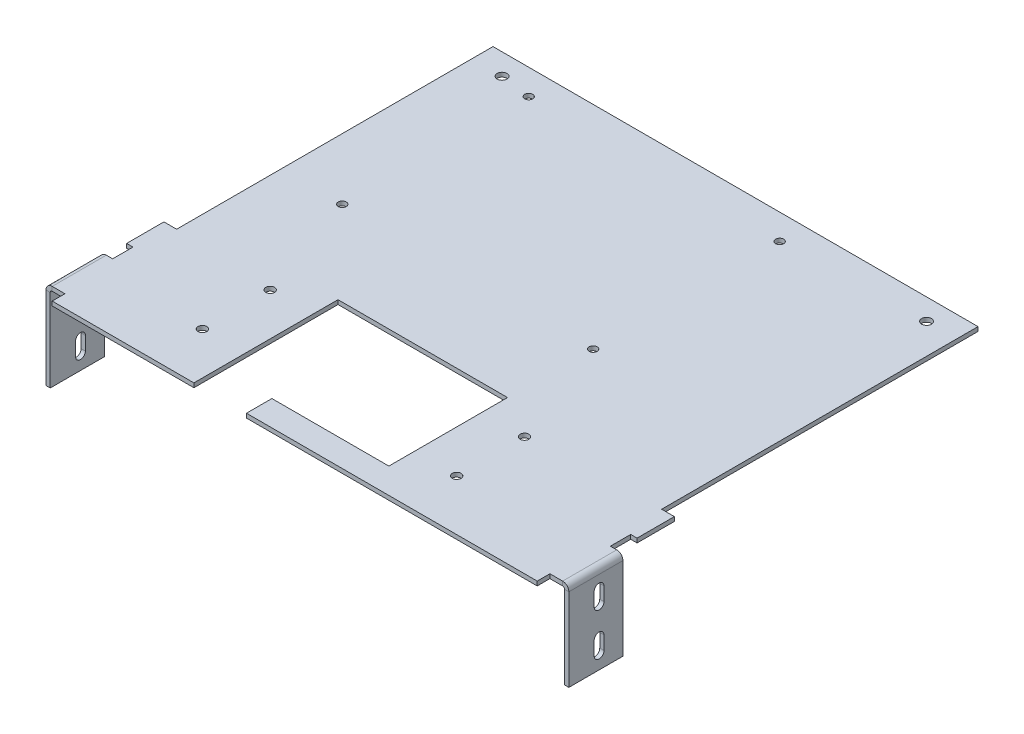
ISO-10303-21;
HEADER;
FILE_DESCRIPTION(('STEP AP214'),'2;1');
FILE_NAME('part.step','',(''),(''),'','','');
FILE_SCHEMA(('AUTOMOTIVE_DESIGN { 1 0 10303 214 1 1 1 1 }'));
ENDSEC;
DATA;
#1=APPLICATION_CONTEXT('core data for automotive mechanical design processes');
#2=APPLICATION_PROTOCOL_DEFINITION('international standard','automotive_design',2000,#1);
#3=PRODUCT_CONTEXT('',#1,'mechanical');
#4=PRODUCT('Part','Part','',(#3));
#5=PRODUCT_RELATED_PRODUCT_CATEGORY('part','',(#4));
#6=PRODUCT_DEFINITION_FORMATION('','',#4);
#7=PRODUCT_DEFINITION_CONTEXT('part definition',#1,'design');
#8=PRODUCT_DEFINITION('design','',#6,#7);
#9=PRODUCT_DEFINITION_SHAPE('','',#8);
#10=(LENGTH_UNIT() NAMED_UNIT(*) SI_UNIT(.MILLI.,.METRE.));
#11=(NAMED_UNIT(*) PLANE_ANGLE_UNIT() SI_UNIT($,.RADIAN.));
#12=(NAMED_UNIT(*) SI_UNIT($,.STERADIAN.) SOLID_ANGLE_UNIT());
#13=UNCERTAINTY_MEASURE_WITH_UNIT(LENGTH_MEASURE(1.E-05),#10,'distance_accuracy_value','');
#14=(GEOMETRIC_REPRESENTATION_CONTEXT(3) GLOBAL_UNCERTAINTY_ASSIGNED_CONTEXT((#13)) GLOBAL_UNIT_ASSIGNED_CONTEXT((#10,
#11,#12)) REPRESENTATION_CONTEXT('',''));
#15=CARTESIAN_POINT('',(0.,0.,0.));
#16=DIRECTION('',(0.,0.,1.));
#17=DIRECTION('',(1.,0.,0.));
#18=AXIS2_PLACEMENT_3D('',#15,#16,#17);
#19=CARTESIAN_POINT('',(-95.5929,-1.5875,82.55));
#20=DIRECTION('',(0.,0.,1.));
#21=DIRECTION('',(1.,0.,0.));
#22=AXIS2_PLACEMENT_3D('',#19,#20,#21);
#23=PLANE('',#22);
#24=DIRECTION('',(0.,1.,0.));
#25=VECTOR('',#24,1.);
#26=CARTESIAN_POINT('',(-37.7571,-1.5875,82.55));
#27=LINE('',#26,#25);
#28=CARTESIAN_POINT('',(-37.7571,-1.5875,82.55));
#29=VERTEX_POINT('',#28);
#30=CARTESIAN_POINT('',(-37.7571,0.,82.55));
#31=VERTEX_POINT('',#30);
#32=EDGE_CURVE('E758',#29,#31,#27,.T.);
#33=ORIENTED_EDGE('',*,*,#32,.T.);
#34=DIRECTION('',(1.,0.,0.));
#35=VECTOR('',#34,1.);
#36=CARTESIAN_POINT('',(-95.5929,0.,82.55));
#37=LINE('',#36,#35);
#38=CARTESIAN_POINT('',(-90.8304,0.,82.55));
#39=VERTEX_POINT('',#38);
#40=EDGE_CURVE('E958',#39,#31,#37,.T.);
#41=ORIENTED_EDGE('',*,*,#40,.F.);
#42=DIRECTION('',(0.,1.,0.));
#43=VECTOR('',#42,1.);
#44=CARTESIAN_POINT('',(-90.8304,-1.5875,82.55));
#45=LINE('',#44,#43);
#46=CARTESIAN_POINT('',(-90.8304,-1.5875,82.55));
#47=VERTEX_POINT('',#46);
#48=EDGE_CURVE('E914',#47,#39,#45,.T.);
#49=ORIENTED_EDGE('',*,*,#48,.F.);
#50=DIRECTION('',(1.,0.,0.));
#51=VECTOR('',#50,1.);
#52=CARTESIAN_POINT('',(-95.5929,-1.5875,82.55));
#53=LINE('',#52,#51);
#54=EDGE_CURVE('E966',#47,#29,#53,.T.);
#55=ORIENTED_EDGE('',*,*,#54,.T.);
#56=EDGE_LOOP('',(#33,#41,#49,#55));
#57=FACE_BOUND('',#56,.T.);
#58=ADVANCED_FACE('F85',(#57),#23,.T.);
#59=CARTESIAN_POINT('',(95.5929,-1.5875,82.55));
#60=DIRECTION('',(1.,0.,0.));
#61=DIRECTION('',(0.,0.,-1.));
#62=AXIS2_PLACEMENT_3D('',#59,#60,#61);
#63=PLANE('',#62);
#64=DIRECTION('',(0.,1.,0.));
#65=VECTOR('',#64,1.);
#66=CARTESIAN_POINT('',(95.5929,-1.5875,35.9409999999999));
#67=LINE('',#66,#65);
#68=CARTESIAN_POINT('',(95.5929,-1.5875,35.9409999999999));
#69=VERTEX_POINT('',#68);
#70=CARTESIAN_POINT('',(95.5929,0.,35.9409999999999));
#71=VERTEX_POINT('',#70);
#72=EDGE_CURVE('E895',#69,#71,#67,.T.);
#73=ORIENTED_EDGE('',*,*,#72,.T.);
#74=DIRECTION('',(0.,0.,-1.));
#75=VECTOR('',#74,1.);
#76=CARTESIAN_POINT('',(95.5929,0.,82.55));
#77=LINE('',#76,#75);
#78=CARTESIAN_POINT('',(95.5929,0.,49.9109999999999));
#79=VERTEX_POINT('',#78);
#80=EDGE_CURVE('E948',#79,#71,#77,.T.);
#81=ORIENTED_EDGE('',*,*,#80,.F.);
#82=DIRECTION('',(0.,1.,0.));
#83=VECTOR('',#82,1.);
#84=CARTESIAN_POINT('',(95.5929,-1.5875,49.9109999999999));
#85=LINE('',#84,#83);
#86=CARTESIAN_POINT('',(95.5929,-1.5875,49.9109999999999));
#87=VERTEX_POINT('',#86);
#88=EDGE_CURVE('E800',#87,#79,#85,.T.);
#89=ORIENTED_EDGE('',*,*,#88,.F.);
#90=DIRECTION('',(0.,0.,-1.));
#91=VECTOR('',#90,1.);
#92=CARTESIAN_POINT('',(95.5929,-1.5875,82.55));
#93=LINE('',#92,#91);
#94=EDGE_CURVE('E954',#87,#69,#93,.T.);
#95=ORIENTED_EDGE('',*,*,#94,.T.);
#96=EDGE_LOOP('',(#73,#81,#89,#95));
#97=FACE_BOUND('',#96,.T.);
#98=ADVANCED_FACE('F87',(#97),#63,.T.);
#99=CARTESIAN_POINT('',(-95.5929,-1.5875,82.55));
#100=DIRECTION('',(-1.,0.,0.));
#101=DIRECTION('',(0.,0.,1.));
#102=AXIS2_PLACEMENT_3D('',#99,#100,#101);
#103=PLANE('',#102);
#104=DIRECTION('',(0.,1.,0.));
#105=VECTOR('',#104,1.);
#106=CARTESIAN_POINT('',(-95.5929,-1.5875,49.9109999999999));
#107=LINE('',#106,#105);
#108=CARTESIAN_POINT('',(-95.5929,-1.5875,49.9109999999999));
#109=VERTEX_POINT('',#108);
#110=CARTESIAN_POINT('',(-95.5929,0.,49.9109999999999));
#111=VERTEX_POINT('',#110);
#112=EDGE_CURVE('E839',#109,#111,#107,.T.);
#113=ORIENTED_EDGE('',*,*,#112,.T.);
#114=DIRECTION('',(0.,0.,1.));
#115=VECTOR('',#114,1.);
#116=CARTESIAN_POINT('',(-95.5929,0.,82.55));
#117=LINE('',#116,#115);
#118=CARTESIAN_POINT('',(-95.5929,0.,35.9409999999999));
#119=VERTEX_POINT('',#118);
#120=EDGE_CURVE('E981',#119,#111,#117,.T.);
#121=ORIENTED_EDGE('',*,*,#120,.F.);
#122=DIRECTION('',(0.,1.,0.));
#123=VECTOR('',#122,1.);
#124=CARTESIAN_POINT('',(-95.5929,-1.5875,35.9409999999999));
#125=LINE('',#124,#123);
#126=CARTESIAN_POINT('',(-95.5929,-1.5875,35.9409999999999));
#127=VERTEX_POINT('',#126);
#128=EDGE_CURVE('E938',#127,#119,#125,.T.);
#129=ORIENTED_EDGE('',*,*,#128,.F.);
#130=DIRECTION('',(0.,0.,1.));
#131=VECTOR('',#130,1.);
#132=CARTESIAN_POINT('',(-95.5929,-1.5875,82.55));
#133=LINE('',#132,#131);
#134=EDGE_CURVE('E965',#127,#109,#133,.T.);
#135=ORIENTED_EDGE('',*,*,#134,.T.);
#136=EDGE_LOOP('',(#113,#121,#129,#135));
#137=FACE_BOUND('',#136,.T.);
#138=ADVANCED_FACE('F1089',(#137),#103,.T.);
#139=DIRECTION('',(0.,1.,0.));
#140=VECTOR('',#139,1.);
#141=CARTESIAN_POINT('',(-18.0721,-1.5875,82.55));
#142=LINE('',#141,#140);
#143=CARTESIAN_POINT('',(-18.0721,-1.5875,82.55));
#144=VERTEX_POINT('',#143);
#145=CARTESIAN_POINT('',(-18.0721,0.,82.55));
#146=VERTEX_POINT('',#145);
#147=EDGE_CURVE('E740',#144,#146,#142,.T.);
#148=ORIENTED_EDGE('',*,*,#147,.F.);
#149=CARTESIAN_POINT('',(90.8304,-1.5875,82.55));
#150=VERTEX_POINT('',#149);
#151=EDGE_CURVE('E970',#144,#150,#53,.T.);
#152=ORIENTED_EDGE('',*,*,#151,.T.);
#153=DIRECTION('',(0.,1.,0.));
#154=VECTOR('',#153,1.);
#155=CARTESIAN_POINT('',(90.8304,-1.5875,82.55));
#156=LINE('',#155,#154);
#157=CARTESIAN_POINT('',(90.8304,0.,82.55));
#158=VERTEX_POINT('',#157);
#159=EDGE_CURVE('E871',#150,#158,#156,.T.);
#160=ORIENTED_EDGE('',*,*,#159,.T.);
#161=EDGE_CURVE('E984',#146,#158,#37,.T.);
#162=ORIENTED_EDGE('',*,*,#161,.F.);
#163=EDGE_LOOP('',(#148,#152,#160,#162));
#164=FACE_BOUND('',#163,.T.);
#165=ADVANCED_FACE('F1085',(#164),#23,.T.);
#166=CARTESIAN_POINT('',(-95.5929,-1.5875,-82.55));
#167=DIRECTION('',(0.,0.,-1.));
#168=DIRECTION('',(-1.,0.,0.));
#169=AXIS2_PLACEMENT_3D('',#166,#167,#168);
#170=PLANE('',#169);
#171=DIRECTION('',(0.,1.,0.));
#172=VECTOR('',#171,1.);
#173=CARTESIAN_POINT('',(90.8304,-1.5875,-82.55));
#174=LINE('',#173,#172);
#175=CARTESIAN_POINT('',(90.8304,-1.5875,-82.55));
#176=VERTEX_POINT('',#175);
#177=CARTESIAN_POINT('',(90.8304,0.,-82.55));
#178=VERTEX_POINT('',#177);
#179=EDGE_CURVE('E887',#176,#178,#174,.T.);
#180=ORIENTED_EDGE('',*,*,#179,.F.);
#181=DIRECTION('',(-1.,0.,0.));
#182=VECTOR('',#181,1.);
#183=CARTESIAN_POINT('',(-95.5929,-1.5875,-82.55));
#184=LINE('',#183,#182);
#185=CARTESIAN_POINT('',(-90.8304,-1.5875,-82.55));
#186=VERTEX_POINT('',#185);
#187=EDGE_CURVE('E959',#176,#186,#184,.T.);
#188=ORIENTED_EDGE('',*,*,#187,.T.);
#189=DIRECTION('',(0.,1.,0.));
#190=VECTOR('',#189,1.);
#191=CARTESIAN_POINT('',(-90.8304,-1.5875,-82.55));
#192=LINE('',#191,#190);
#193=CARTESIAN_POINT('',(-90.8304,0.,-82.55));
#194=VERTEX_POINT('',#193);
#195=EDGE_CURVE('E944',#186,#194,#192,.T.);
#196=ORIENTED_EDGE('',*,*,#195,.T.);
#197=DIRECTION('',(-1.,0.,0.));
#198=VECTOR('',#197,1.);
#199=CARTESIAN_POINT('',(-95.5929,0.,-82.55));
#200=LINE('',#199,#198);
#201=EDGE_CURVE('E974',#178,#194,#200,.T.);
#202=ORIENTED_EDGE('',*,*,#201,.F.);
#203=EDGE_LOOP('',(#180,#188,#196,#202));
#204=FACE_BOUND('',#203,.T.);
#205=ADVANCED_FACE('F1094',(#204),#170,.T.);
#206=CARTESIAN_POINT('',(0.,-1.5875,0.));
#207=DIRECTION('',(0.,-1.,0.));
#208=DIRECTION('',(0.,0.,-1.));
#209=AXIS2_PLACEMENT_3D('',#206,#207,#208);
#210=PLANE('',#209);
#211=CARTESIAN_POINT('',(79.50835,-1.5875,-74.6125));
#212=DIRECTION('',(0.,-1.,0.));
#213=DIRECTION('',(0.,0.,-1.));
#214=AXIS2_PLACEMENT_3D('',#211,#212,#213);
#215=CIRCLE('',#214,1.84150000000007);
#216=CARTESIAN_POINT('',(79.50835,-1.5875,-76.4540000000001));
#217=VERTEX_POINT('',#216);
#218=EDGE_CURVE('E440',#217,#217,#215,.T.);
#219=ORIENTED_EDGE('',*,*,#218,.F.);
#220=EDGE_LOOP('',(#219));
#221=FACE_BOUND('',#220,.T.);
#222=CARTESIAN_POINT('',(-79.50835,-1.5875,-74.6125));
#223=DIRECTION('',(0.,-1.,0.));
#224=DIRECTION('',(0.,0.,-1.));
#225=AXIS2_PLACEMENT_3D('',#222,#223,#224);
#226=CIRCLE('',#225,1.84150000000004);
#227=CARTESIAN_POINT('',(-79.50835,-1.5875,-76.454));
#228=VERTEX_POINT('',#227);
#229=EDGE_CURVE('E1414',#228,#228,#226,.T.);
#230=ORIENTED_EDGE('',*,*,#229,.F.);
#231=EDGE_LOOP('',(#230));
#232=FACE_BOUND('',#231,.T.);
#233=CARTESIAN_POINT('',(-67.9196000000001,-1.5875,-73.025));
#234=DIRECTION('',(0.,1.,0.));
#235=DIRECTION('',(0.,0.,1.));
#236=AXIS2_PLACEMENT_3D('',#233,#234,#235);
#237=CIRCLE('',#236,1.5);
#238=CARTESIAN_POINT('',(-67.9196000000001,-1.5875,-71.525));
#239=VERTEX_POINT('',#238);
#240=EDGE_CURVE('E663',#239,#239,#237,.T.);
#241=ORIENTED_EDGE('',*,*,#240,.T.);
#242=EDGE_LOOP('',(#241));
#243=FACE_BOUND('',#242,.T.);
#244=CARTESIAN_POINT('',(26.0604,-1.5875,-3.17500000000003));
#245=DIRECTION('',(0.,1.,0.));
#246=DIRECTION('',(0.,0.,1.));
#247=AXIS2_PLACEMENT_3D('',#244,#245,#246);
#248=CIRCLE('',#247,1.5);
#249=CARTESIAN_POINT('',(26.0604,-1.5875,-1.67500000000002));
#250=VERTEX_POINT('',#249);
#251=EDGE_CURVE('E672',#250,#250,#248,.T.);
#252=ORIENTED_EDGE('',*,*,#251,.T.);
#253=EDGE_LOOP('',(#252));
#254=FACE_BOUND('',#253,.T.);
#255=CARTESIAN_POINT('',(-67.9196,-1.5875,-3.17499999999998));
#256=DIRECTION('',(0.,1.,0.));
#257=DIRECTION('',(0.,0.,1.));
#258=AXIS2_PLACEMENT_3D('',#255,#256,#257);
#259=CIRCLE('',#258,1.5);
#260=CARTESIAN_POINT('',(-67.9196,-1.5875,-1.67499999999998));
#261=VERTEX_POINT('',#260);
#262=EDGE_CURVE('E655',#261,#261,#259,.T.);
#263=ORIENTED_EDGE('',*,*,#262,.T.);
#264=EDGE_LOOP('',(#263));
#265=FACE_BOUND('',#264,.T.);
#266=CARTESIAN_POINT('',(26.0603999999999,-1.5875,-73.025));
#267=DIRECTION('',(0.,1.,0.));
#268=DIRECTION('',(0.,0.,1.));
#269=AXIS2_PLACEMENT_3D('',#266,#267,#268);
#270=CIRCLE('',#269,1.5);
#271=CARTESIAN_POINT('',(26.0603999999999,-1.5875,-71.525));
#272=VERTEX_POINT('',#271);
#273=EDGE_CURVE('E679',#272,#272,#270,.T.);
#274=ORIENTED_EDGE('',*,*,#273,.T.);
#275=EDGE_LOOP('',(#274));
#276=FACE_BOUND('',#275,.T.);
#277=CARTESIAN_POINT('',(41.6179,-1.5875,38.1));
#278=DIRECTION('',(0.,1.,0.));
#279=DIRECTION('',(0.,0.,-1.));
#280=AXIS2_PLACEMENT_3D('',#277,#278,#279);
#281=CIRCLE('',#280,1.651);
#282=CARTESIAN_POINT('',(41.6179,-1.5875,36.449));
#283=VERTEX_POINT('',#282);
#284=EDGE_CURVE('E712',#283,#283,#281,.T.);
#285=ORIENTED_EDGE('',*,*,#284,.T.);
#286=EDGE_LOOP('',(#285));
#287=FACE_BOUND('',#286,.T.);
#288=CARTESIAN_POINT('',(41.6179,-1.5875,63.5));
#289=DIRECTION('',(0.,1.,0.));
#290=DIRECTION('',(0.,0.,-1.));
#291=AXIS2_PLACEMENT_3D('',#288,#289,#290);
#292=CIRCLE('',#291,1.651);
#293=CARTESIAN_POINT('',(41.6179,-1.5875,61.849));
#294=VERTEX_POINT('',#293);
#295=EDGE_CURVE('E704',#294,#294,#292,.T.);
#296=ORIENTED_EDGE('',*,*,#295,.T.);
#297=EDGE_LOOP('',(#296));
#298=FACE_BOUND('',#297,.T.);
#299=CARTESIAN_POINT('',(-53.6321,-1.5875,63.5));
#300=DIRECTION('',(0.,1.,0.));
#301=DIRECTION('',(0.,0.,1.));
#302=AXIS2_PLACEMENT_3D('',#299,#300,#301);
#303=CIRCLE('',#302,1.651);
#304=CARTESIAN_POINT('',(-53.6321,-1.5875,65.151));
#305=VERTEX_POINT('',#304);
#306=EDGE_CURVE('E696',#305,#305,#303,.T.);
#307=ORIENTED_EDGE('',*,*,#306,.T.);
#308=EDGE_LOOP('',(#307));
#309=FACE_BOUND('',#308,.T.);
#310=CARTESIAN_POINT('',(-53.6321,-1.5875,38.1));
#311=DIRECTION('',(0.,1.,0.));
#312=DIRECTION('',(0.,0.,1.));
#313=AXIS2_PLACEMENT_3D('',#310,#311,#312);
#314=CIRCLE('',#313,1.651);
#315=CARTESIAN_POINT('',(-53.6321,-1.5875,39.751));
#316=VERTEX_POINT('',#315);
#317=EDGE_CURVE('E687',#316,#316,#314,.T.);
#318=ORIENTED_EDGE('',*,*,#317,.T.);
#319=EDGE_LOOP('',(#318));
#320=FACE_BOUND('',#319,.T.);
#321=DIRECTION('',(0.,0.,1.));
#322=VECTOR('',#321,1.);
#323=CARTESIAN_POINT('',(-37.7571,-1.5875,73.025));
#324=LINE('',#323,#322);
#325=CARTESIAN_POINT('',(-37.7571,-1.5875,28.575));
#326=VERTEX_POINT('',#325);
#327=EDGE_CURVE('E736',#326,#29,#324,.T.);
#328=ORIENTED_EDGE('',*,*,#327,.T.);
#329=ORIENTED_EDGE('',*,*,#54,.F.);
#330=DIRECTION('',(0.,0.,-1.));
#331=VECTOR('',#330,1.);
#332=CARTESIAN_POINT('',(-90.8304,-1.5875,77.7875));
#333=LINE('',#332,#331);
#334=CARTESIAN_POINT('',(-90.8304,-1.5875,77.7875));
#335=VERTEX_POINT('',#334);
#336=EDGE_CURVE('E905',#47,#335,#333,.T.);
#337=ORIENTED_EDGE('',*,*,#336,.T.);
#338=DIRECTION('',(-1.,0.,0.));
#339=VECTOR('',#338,1.);
#340=CARTESIAN_POINT('',(-95.5929,-1.5875,77.7875));
#341=LINE('',#340,#339);
#342=CARTESIAN_POINT('',(-95.5929,-1.58750000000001,77.7875));
#343=VERTEX_POINT('',#342);
#344=EDGE_CURVE('E909',#335,#343,#341,.T.);
#345=ORIENTED_EDGE('',*,*,#344,.T.);
#346=CARTESIAN_POINT('',(-95.5929,-1.58750000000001,57.5309999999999));
#347=VERTEX_POINT('',#346);
#348=EDGE_CURVE('E962',#347,#343,#133,.T.);
#349=ORIENTED_EDGE('',*,*,#348,.F.);
#350=DIRECTION('',(1.,0.,0.));
#351=VECTOR('',#350,1.);
#352=CARTESIAN_POINT('',(-95.5929,-1.5875,57.5309999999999));
#353=LINE('',#352,#351);
#354=CARTESIAN_POINT('',(-93.21165,-1.5875,57.5309999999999));
#355=VERTEX_POINT('',#354);
#356=EDGE_CURVE('E814',#347,#355,#353,.T.);
#357=ORIENTED_EDGE('',*,*,#356,.T.);
#358=DIRECTION('',(0.,0.,-1.));
#359=VECTOR('',#358,1.);
#360=CARTESIAN_POINT('',(-93.21165,-1.5875,49.911));
#361=LINE('',#360,#359);
#362=CARTESIAN_POINT('',(-93.21165,-1.5875,49.911));
#363=VERTEX_POINT('',#362);
#364=EDGE_CURVE('E818',#355,#363,#361,.T.);
#365=ORIENTED_EDGE('',*,*,#364,.T.);
#366=DIRECTION('',(-1.,0.,0.));
#367=VECTOR('',#366,1.);
#368=CARTESIAN_POINT('',(-95.5929,-1.5875,49.9109999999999));
#369=LINE('',#368,#367);
#370=EDGE_CURVE('E823',#363,#109,#369,.T.);
#371=ORIENTED_EDGE('',*,*,#370,.T.);
#372=ORIENTED_EDGE('',*,*,#134,.F.);
#373=DIRECTION('',(1.,0.,0.));
#374=VECTOR('',#373,1.);
#375=CARTESIAN_POINT('',(-95.5929,-1.5875,35.9409999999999));
#376=LINE('',#375,#374);
#377=CARTESIAN_POINT('',(-90.8304,-1.5875,35.9409999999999));
#378=VERTEX_POINT('',#377);
#379=EDGE_CURVE('E929',#127,#378,#376,.T.);
#380=ORIENTED_EDGE('',*,*,#379,.T.);
#381=DIRECTION('',(0.,0.,-1.));
#382=VECTOR('',#381,1.);
#383=CARTESIAN_POINT('',(-90.8304,-1.5875,-82.55));
#384=LINE('',#383,#382);
#385=EDGE_CURVE('E933',#378,#186,#384,.T.);
#386=ORIENTED_EDGE('',*,*,#385,.T.);
#387=ORIENTED_EDGE('',*,*,#187,.F.);
#388=DIRECTION('',(0.,0.,1.));
#389=VECTOR('',#388,1.);
#390=CARTESIAN_POINT('',(90.8304,-1.5875,-82.55));
#391=LINE('',#390,#389);
#392=CARTESIAN_POINT('',(90.8304,-1.5875,35.9409999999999));
#393=VERTEX_POINT('',#392);
#394=EDGE_CURVE('E878',#176,#393,#391,.T.);
#395=ORIENTED_EDGE('',*,*,#394,.T.);
#396=DIRECTION('',(1.,0.,0.));
#397=VECTOR('',#396,1.);
#398=CARTESIAN_POINT('',(95.5929,-1.5875,35.9409999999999));
#399=LINE('',#398,#397);
#400=EDGE_CURVE('E882',#393,#69,#399,.T.);
#401=ORIENTED_EDGE('',*,*,#400,.T.);
#402=ORIENTED_EDGE('',*,*,#94,.F.);
#403=DIRECTION('',(-1.,0.,0.));
#404=VECTOR('',#403,1.);
#405=CARTESIAN_POINT('',(95.5929,-1.5875,49.9109999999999));
#406=LINE('',#405,#404);
#407=CARTESIAN_POINT('',(93.21165,-1.5875,49.911));
#408=VERTEX_POINT('',#407);
#409=EDGE_CURVE('E777',#87,#408,#406,.T.);
#410=ORIENTED_EDGE('',*,*,#409,.T.);
#411=DIRECTION('',(0.,0.,1.));
#412=VECTOR('',#411,1.);
#413=CARTESIAN_POINT('',(93.21165,-1.5875,49.911));
#414=LINE('',#413,#412);
#415=CARTESIAN_POINT('',(93.21165,-1.5875,57.5309999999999));
#416=VERTEX_POINT('',#415);
#417=EDGE_CURVE('E781',#408,#416,#414,.T.);
#418=ORIENTED_EDGE('',*,*,#417,.T.);
#419=DIRECTION('',(1.,0.,0.));
#420=VECTOR('',#419,1.);
#421=CARTESIAN_POINT('',(95.5929,-1.5875,57.5309999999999));
#422=LINE('',#421,#420);
#423=CARTESIAN_POINT('',(95.5929,-1.58750000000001,57.5309999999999));
#424=VERTEX_POINT('',#423);
#425=EDGE_CURVE('E786',#416,#424,#422,.T.);
#426=ORIENTED_EDGE('',*,*,#425,.T.);
#427=CARTESIAN_POINT('',(95.5929,-1.58750000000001,77.7875));
#428=VERTEX_POINT('',#427);
#429=EDGE_CURVE('E957',#428,#424,#93,.T.);
#430=ORIENTED_EDGE('',*,*,#429,.F.);
#431=DIRECTION('',(-1.,0.,0.));
#432=VECTOR('',#431,1.);
#433=CARTESIAN_POINT('',(95.5929,-1.5875,77.7875));
#434=LINE('',#433,#432);
#435=CARTESIAN_POINT('',(90.8304,-1.5875,77.7875));
#436=VERTEX_POINT('',#435);
#437=EDGE_CURVE('E853',#428,#436,#434,.T.);
#438=ORIENTED_EDGE('',*,*,#437,.T.);
#439=DIRECTION('',(0.,0.,1.));
#440=VECTOR('',#439,1.);
#441=CARTESIAN_POINT('',(90.8304,-1.5875,77.7875));
#442=LINE('',#441,#440);
#443=EDGE_CURVE('E857',#436,#150,#442,.T.);
#444=ORIENTED_EDGE('',*,*,#443,.T.);
#445=ORIENTED_EDGE('',*,*,#151,.F.);
#446=DIRECTION('',(0.,0.,-1.));
#447=VECTOR('',#446,1.);
#448=CARTESIAN_POINT('',(-18.0721,-1.5875,73.025));
#449=LINE('',#448,#447);
#450=CARTESIAN_POINT('',(-18.0721,-1.5875,73.025));
#451=VERTEX_POINT('',#450);
#452=EDGE_CURVE('E719',#144,#451,#449,.T.);
#453=ORIENTED_EDGE('',*,*,#452,.T.);
#454=DIRECTION('',(1.,0.,0.));
#455=VECTOR('',#454,1.);
#456=CARTESIAN_POINT('',(-6.00709999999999,-1.5875,73.025));
#457=LINE('',#456,#455);
#458=CARTESIAN_POINT('',(25.7429,-1.5875,73.025));
#459=VERTEX_POINT('',#458);
#460=EDGE_CURVE('E723',#451,#459,#457,.T.);
#461=ORIENTED_EDGE('',*,*,#460,.T.);
#462=DIRECTION('',(0.,0.,-1.));
#463=VECTOR('',#462,1.);
#464=CARTESIAN_POINT('',(25.7429,-1.5875,73.025));
#465=LINE('',#464,#463);
#466=CARTESIAN_POINT('',(25.7429,-1.5875,28.575));
#467=VERTEX_POINT('',#466);
#468=EDGE_CURVE('E728',#459,#467,#465,.T.);
#469=ORIENTED_EDGE('',*,*,#468,.T.);
#470=DIRECTION('',(-1.,0.,0.));
#471=VECTOR('',#470,1.);
#472=CARTESIAN_POINT('',(-37.7571,-1.5875,28.575));
#473=LINE('',#472,#471);
#474=EDGE_CURVE('E732',#467,#326,#473,.T.);
#475=ORIENTED_EDGE('',*,*,#474,.T.);
#476=EDGE_LOOP('',(#328,#329,#337,#345,#349,#357,#365,#371,#372,#380,#386,#387,#395,#401,#402,
#410,#418,#426,#430,#438,#444,#445,#453,#461,#469,#475));
#477=FACE_BOUND('',#476,.T.);
#478=ADVANCED_FACE('F1100',(#221,#232,#243,#254,#265,#276,#287,#298,#309,#320,#477),#210,.T.);
#479=CARTESIAN_POINT('',(0.,0.,0.));
#480=DIRECTION('',(0.,-1.,0.));
#481=DIRECTION('',(0.,0.,-1.));
#482=AXIS2_PLACEMENT_3D('',#479,#480,#481);
#483=PLANE('',#482);
#484=CARTESIAN_POINT('',(79.50835,0.,-74.6125));
#485=DIRECTION('',(0.,1.,0.));
#486=DIRECTION('',(0.,0.,1.));
#487=AXIS2_PLACEMENT_3D('',#484,#485,#486);
#488=CIRCLE('',#487,1.84150000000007);
#489=CARTESIAN_POINT('',(79.50835,0.,-72.7709999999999));
#490=VERTEX_POINT('',#489);
#491=EDGE_CURVE('E1379',#490,#490,#488,.T.);
#492=ORIENTED_EDGE('',*,*,#491,.F.);
#493=EDGE_LOOP('',(#492));
#494=FACE_BOUND('',#493,.T.);
#495=CARTESIAN_POINT('',(-79.50835,0.,-74.6125));
#496=DIRECTION('',(0.,1.,0.));
#497=DIRECTION('',(0.,0.,-1.));
#498=AXIS2_PLACEMENT_3D('',#495,#496,#497);
#499=CIRCLE('',#498,1.84150000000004);
#500=CARTESIAN_POINT('',(-79.50835,0.,-76.454));
#501=VERTEX_POINT('',#500);
#502=EDGE_CURVE('E1383',#501,#501,#499,.T.);
#503=ORIENTED_EDGE('',*,*,#502,.F.);
#504=EDGE_LOOP('',(#503));
#505=FACE_BOUND('',#504,.T.);
#506=CARTESIAN_POINT('',(-67.9196000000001,0.,-73.025));
#507=DIRECTION('',(0.,1.,0.));
#508=DIRECTION('',(0.,0.,1.));
#509=AXIS2_PLACEMENT_3D('',#506,#507,#508);
#510=CIRCLE('',#509,1.5);
#511=CARTESIAN_POINT('',(-67.9196000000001,0.,-71.525));
#512=VERTEX_POINT('',#511);
#513=EDGE_CURVE('E668',#512,#512,#510,.T.);
#514=ORIENTED_EDGE('',*,*,#513,.F.);
#515=EDGE_LOOP('',(#514));
#516=FACE_BOUND('',#515,.T.);
#517=CARTESIAN_POINT('',(26.0604,0.,-3.17500000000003));
#518=DIRECTION('',(0.,1.,0.));
#519=DIRECTION('',(0.,0.,1.));
#520=AXIS2_PLACEMENT_3D('',#517,#518,#519);
#521=CIRCLE('',#520,1.5);
#522=CARTESIAN_POINT('',(26.0604,0.,-1.67500000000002));
#523=VERTEX_POINT('',#522);
#524=EDGE_CURVE('E659',#523,#523,#521,.T.);
#525=ORIENTED_EDGE('',*,*,#524,.F.);
#526=EDGE_LOOP('',(#525));
#527=FACE_BOUND('',#526,.T.);
#528=CARTESIAN_POINT('',(-67.9196,0.,-3.17499999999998));
#529=DIRECTION('',(0.,1.,0.));
#530=DIRECTION('',(0.,0.,1.));
#531=AXIS2_PLACEMENT_3D('',#528,#529,#530);
#532=CIRCLE('',#531,1.5);
#533=CARTESIAN_POINT('',(-67.9196,0.,-1.67499999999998));
#534=VERTEX_POINT('',#533);
#535=EDGE_CURVE('E643',#534,#534,#532,.T.);
#536=ORIENTED_EDGE('',*,*,#535,.F.);
#537=EDGE_LOOP('',(#536));
#538=FACE_BOUND('',#537,.T.);
#539=CARTESIAN_POINT('',(26.0603999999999,0.,-73.025));
#540=DIRECTION('',(0.,1.,0.));
#541=DIRECTION('',(0.,0.,1.));
#542=AXIS2_PLACEMENT_3D('',#539,#540,#541);
#543=CIRCLE('',#542,1.5);
#544=CARTESIAN_POINT('',(26.0603999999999,0.,-71.525));
#545=VERTEX_POINT('',#544);
#546=EDGE_CURVE('E667',#545,#545,#543,.T.);
#547=ORIENTED_EDGE('',*,*,#546,.F.);
#548=EDGE_LOOP('',(#547));
#549=FACE_BOUND('',#548,.T.);
#550=CARTESIAN_POINT('',(41.6179,0.,38.1));
#551=DIRECTION('',(0.,1.,0.));
#552=DIRECTION('',(0.,0.,-1.));
#553=AXIS2_PLACEMENT_3D('',#550,#551,#552);
#554=CIRCLE('',#553,1.651);
#555=CARTESIAN_POINT('',(41.6179,0.,36.449));
#556=VERTEX_POINT('',#555);
#557=EDGE_CURVE('E683',#556,#556,#554,.T.);
#558=ORIENTED_EDGE('',*,*,#557,.F.);
#559=EDGE_LOOP('',(#558));
#560=FACE_BOUND('',#559,.T.);
#561=CARTESIAN_POINT('',(41.6179,0.,63.5));
#562=DIRECTION('',(0.,1.,0.));
#563=DIRECTION('',(0.,0.,-1.));
#564=AXIS2_PLACEMENT_3D('',#561,#562,#563);
#565=CIRCLE('',#564,1.651);
#566=CARTESIAN_POINT('',(41.6179,0.,61.849));
#567=VERTEX_POINT('',#566);
#568=EDGE_CURVE('E708',#567,#567,#565,.T.);
#569=ORIENTED_EDGE('',*,*,#568,.F.);
#570=EDGE_LOOP('',(#569));
#571=FACE_BOUND('',#570,.T.);
#572=CARTESIAN_POINT('',(-53.6321,0.,63.5));
#573=DIRECTION('',(0.,1.,0.));
#574=DIRECTION('',(0.,0.,1.));
#575=AXIS2_PLACEMENT_3D('',#572,#573,#574);
#576=CIRCLE('',#575,1.651);
#577=CARTESIAN_POINT('',(-53.6321,0.,65.151));
#578=VERTEX_POINT('',#577);
#579=EDGE_CURVE('E700',#578,#578,#576,.T.);
#580=ORIENTED_EDGE('',*,*,#579,.F.);
#581=EDGE_LOOP('',(#580));
#582=FACE_BOUND('',#581,.T.);
#583=CARTESIAN_POINT('',(-53.6321,0.,38.1));
#584=DIRECTION('',(0.,1.,0.));
#585=DIRECTION('',(0.,0.,1.));
#586=AXIS2_PLACEMENT_3D('',#583,#584,#585);
#587=CIRCLE('',#586,1.651);
#588=CARTESIAN_POINT('',(-53.6321,0.,39.751));
#589=VERTEX_POINT('',#588);
#590=EDGE_CURVE('E692',#589,#589,#587,.T.);
#591=ORIENTED_EDGE('',*,*,#590,.F.);
#592=EDGE_LOOP('',(#591));
#593=FACE_BOUND('',#592,.T.);
#594=ORIENTED_EDGE('',*,*,#40,.T.);
#595=DIRECTION('',(0.,0.,1.));
#596=VECTOR('',#595,1.);
#597=CARTESIAN_POINT('',(-37.7571,0.,73.025));
#598=LINE('',#597,#596);
#599=CARTESIAN_POINT('',(-37.7571,0.,28.575));
#600=VERTEX_POINT('',#599);
#601=EDGE_CURVE('E724',#600,#31,#598,.T.);
#602=ORIENTED_EDGE('',*,*,#601,.F.);
#603=DIRECTION('',(-1.,0.,0.));
#604=VECTOR('',#603,1.);
#605=CARTESIAN_POINT('',(-37.7571,0.,28.575));
#606=LINE('',#605,#604);
#607=CARTESIAN_POINT('',(25.7429,0.,28.575));
#608=VERTEX_POINT('',#607);
#609=EDGE_CURVE('E752',#608,#600,#606,.T.);
#610=ORIENTED_EDGE('',*,*,#609,.F.);
#611=DIRECTION('',(0.,0.,-1.));
#612=VECTOR('',#611,1.);
#613=CARTESIAN_POINT('',(25.7429,0.,73.025));
#614=LINE('',#613,#612);
#615=CARTESIAN_POINT('',(25.7429,0.,73.025));
#616=VERTEX_POINT('',#615);
#617=EDGE_CURVE('E748',#616,#608,#614,.T.);
#618=ORIENTED_EDGE('',*,*,#617,.F.);
#619=DIRECTION('',(1.,0.,0.));
#620=VECTOR('',#619,1.);
#621=CARTESIAN_POINT('',(-6.00709999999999,0.,73.025));
#622=LINE('',#621,#620);
#623=CARTESIAN_POINT('',(-18.0721,0.,73.025));
#624=VERTEX_POINT('',#623);
#625=EDGE_CURVE('E744',#624,#616,#622,.T.);
#626=ORIENTED_EDGE('',*,*,#625,.F.);
#627=DIRECTION('',(0.,0.,-1.));
#628=VECTOR('',#627,1.);
#629=CARTESIAN_POINT('',(-18.0721,0.,73.025));
#630=LINE('',#629,#628);
#631=EDGE_CURVE('E691',#146,#624,#630,.T.);
#632=ORIENTED_EDGE('',*,*,#631,.F.);
#633=ORIENTED_EDGE('',*,*,#161,.T.);
#634=DIRECTION('',(0.,0.,1.));
#635=VECTOR('',#634,1.);
#636=CARTESIAN_POINT('',(90.8304,0.,77.7875));
#637=LINE('',#636,#635);
#638=CARTESIAN_POINT('',(90.8304,0.,77.7875));
#639=VERTEX_POINT('',#638);
#640=EDGE_CURVE('E858',#639,#158,#637,.T.);
#641=ORIENTED_EDGE('',*,*,#640,.F.);
#642=DIRECTION('',(-1.,0.,0.));
#643=VECTOR('',#642,1.);
#644=CARTESIAN_POINT('',(95.5929,0.,77.7875));
#645=LINE('',#644,#643);
#646=CARTESIAN_POINT('',(95.5929,0.,77.7875));
#647=VERTEX_POINT('',#646);
#648=EDGE_CURVE('E803',#647,#639,#645,.T.);
#649=ORIENTED_EDGE('',*,*,#648,.F.);
#650=CARTESIAN_POINT('',(95.5929,0.,57.5309999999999));
#651=VERTEX_POINT('',#650);
#652=EDGE_CURVE('E973',#647,#651,#77,.T.);
#653=ORIENTED_EDGE('',*,*,#652,.T.);
#654=DIRECTION('',(1.,0.,0.));
#655=VECTOR('',#654,1.);
#656=CARTESIAN_POINT('',(95.5929,0.,57.5309999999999));
#657=LINE('',#656,#655);
#658=CARTESIAN_POINT('',(93.21165,0.,57.5309999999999));
#659=VERTEX_POINT('',#658);
#660=EDGE_CURVE('E782',#659,#651,#657,.T.);
#661=ORIENTED_EDGE('',*,*,#660,.F.);
#662=DIRECTION('',(0.,0.,1.));
#663=VECTOR('',#662,1.);
#664=CARTESIAN_POINT('',(93.21165,0.,49.911));
#665=LINE('',#664,#663);
#666=CARTESIAN_POINT('',(93.21165,0.,49.911));
#667=VERTEX_POINT('',#666);
#668=EDGE_CURVE('E793',#667,#659,#665,.T.);
#669=ORIENTED_EDGE('',*,*,#668,.F.);
#670=DIRECTION('',(-1.,0.,0.));
#671=VECTOR('',#670,1.);
#672=CARTESIAN_POINT('',(95.5929,0.,49.9109999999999));
#673=LINE('',#672,#671);
#674=EDGE_CURVE('E762',#79,#667,#673,.T.);
#675=ORIENTED_EDGE('',*,*,#674,.F.);
#676=ORIENTED_EDGE('',*,*,#80,.T.);
#677=DIRECTION('',(1.,0.,0.));
#678=VECTOR('',#677,1.);
#679=CARTESIAN_POINT('',(95.5929,0.,35.9409999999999));
#680=LINE('',#679,#678);
#681=CARTESIAN_POINT('',(90.8304,0.,35.9409999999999));
#682=VERTEX_POINT('',#681);
#683=EDGE_CURVE('E883',#682,#71,#680,.T.);
#684=ORIENTED_EDGE('',*,*,#683,.F.);
#685=DIRECTION('',(0.,0.,1.));
#686=VECTOR('',#685,1.);
#687=CARTESIAN_POINT('',(90.8304,0.,-82.55));
#688=LINE('',#687,#686);
#689=EDGE_CURVE('E888',#178,#682,#688,.T.);
#690=ORIENTED_EDGE('',*,*,#689,.F.);
#691=ORIENTED_EDGE('',*,*,#201,.T.);
#692=DIRECTION('',(0.,0.,-1.));
#693=VECTOR('',#692,1.);
#694=CARTESIAN_POINT('',(-90.8304,0.,-82.55));
#695=LINE('',#694,#693);
#696=CARTESIAN_POINT('',(-90.8304,0.,35.9409999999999));
#697=VERTEX_POINT('',#696);
#698=EDGE_CURVE('E934',#697,#194,#695,.T.);
#699=ORIENTED_EDGE('',*,*,#698,.F.);
#700=DIRECTION('',(1.,0.,0.));
#701=VECTOR('',#700,1.);
#702=CARTESIAN_POINT('',(-95.5929,0.,35.9409999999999));
#703=LINE('',#702,#701);
#704=EDGE_CURVE('E899',#119,#697,#703,.T.);
#705=ORIENTED_EDGE('',*,*,#704,.F.);
#706=ORIENTED_EDGE('',*,*,#120,.T.);
#707=DIRECTION('',(-1.,0.,0.));
#708=VECTOR('',#707,1.);
#709=CARTESIAN_POINT('',(-95.5929,0.,49.9109999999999));
#710=LINE('',#709,#708);
#711=CARTESIAN_POINT('',(-93.21165,0.,49.911));
#712=VERTEX_POINT('',#711);
#713=EDGE_CURVE('E819',#712,#111,#710,.T.);
#714=ORIENTED_EDGE('',*,*,#713,.F.);
#715=DIRECTION('',(0.,0.,-1.));
#716=VECTOR('',#715,1.);
#717=CARTESIAN_POINT('',(-93.21165,0.,49.911));
#718=LINE('',#717,#716);
#719=CARTESIAN_POINT('',(-93.21165,0.,57.5309999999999));
#720=VERTEX_POINT('',#719);
#721=EDGE_CURVE('E832',#720,#712,#718,.T.);
#722=ORIENTED_EDGE('',*,*,#721,.F.);
#723=DIRECTION('',(1.,0.,0.));
#724=VECTOR('',#723,1.);
#725=CARTESIAN_POINT('',(-95.5929,0.,57.5309999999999));
#726=LINE('',#725,#724);
#727=CARTESIAN_POINT('',(-95.5929,0.,57.5309999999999));
#728=VERTEX_POINT('',#727);
#729=EDGE_CURVE('E828',#728,#720,#726,.T.);
#730=ORIENTED_EDGE('',*,*,#729,.F.);
#731=CARTESIAN_POINT('',(-95.5929,0.,77.7875));
#732=VERTEX_POINT('',#731);
#733=EDGE_CURVE('E977',#728,#732,#117,.T.);
#734=ORIENTED_EDGE('',*,*,#733,.T.);
#735=DIRECTION('',(-1.,0.,0.));
#736=VECTOR('',#735,1.);
#737=CARTESIAN_POINT('',(-95.5929,0.,77.7875));
#738=LINE('',#737,#736);
#739=CARTESIAN_POINT('',(-90.8304,0.,77.7875));
#740=VERTEX_POINT('',#739);
#741=EDGE_CURVE('E910',#740,#732,#738,.T.);
#742=ORIENTED_EDGE('',*,*,#741,.F.);
#743=DIRECTION('',(0.,0.,-1.));
#744=VECTOR('',#743,1.);
#745=CARTESIAN_POINT('',(-90.8304,0.,77.7875));
#746=LINE('',#745,#744);
#747=EDGE_CURVE('E843',#39,#740,#746,.T.);
#748=ORIENTED_EDGE('',*,*,#747,.F.);
#749=EDGE_LOOP('',(#594,#602,#610,#618,#626,#632,#633,#641,#649,#653,#661,#669,#675,#676,#684,
#690,#691,#699,#705,#706,#714,#722,#730,#734,#742,#748));
#750=FACE_BOUND('',#749,.T.);
#751=ADVANCED_FACE('F1123',(#494,#505,#516,#527,#538,#549,#560,#571,#582,#593,#750),#483,.F.);
#752=CARTESIAN_POINT('',(-90.8304,-1.5875,-82.55));
#753=DIRECTION('',(1.,0.,0.));
#754=DIRECTION('',(0.,0.,-1.));
#755=AXIS2_PLACEMENT_3D('',#752,#753,#754);
#756=PLANE('',#755);
#757=ORIENTED_EDGE('',*,*,#698,.T.);
#758=ORIENTED_EDGE('',*,*,#195,.F.);
#759=ORIENTED_EDGE('',*,*,#385,.F.);
#760=DIRECTION('',(0.,1.,0.));
#761=VECTOR('',#760,1.);
#762=CARTESIAN_POINT('',(-90.8304,-1.5875,35.9409999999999));
#763=LINE('',#762,#761);
#764=EDGE_CURVE('E949',#378,#697,#763,.T.);
#765=ORIENTED_EDGE('',*,*,#764,.T.);
#766=EDGE_LOOP('',(#757,#758,#759,#765));
#767=FACE_BOUND('',#766,.T.);
#768=ADVANCED_FACE('F1363',(#767),#756,.F.);
#769=CARTESIAN_POINT('',(-95.5929,-1.5875,35.9409999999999));
#770=DIRECTION('',(0.,0.,1.));
#771=DIRECTION('',(1.,0.,0.));
#772=AXIS2_PLACEMENT_3D('',#769,#770,#771);
#773=PLANE('',#772);
#774=ORIENTED_EDGE('',*,*,#704,.T.);
#775=ORIENTED_EDGE('',*,*,#764,.F.);
#776=ORIENTED_EDGE('',*,*,#379,.F.);
#777=ORIENTED_EDGE('',*,*,#128,.T.);
#778=EDGE_LOOP('',(#774,#775,#776,#777));
#779=FACE_BOUND('',#778,.T.);
#780=ADVANCED_FACE('F1332',(#779),#773,.F.);
#781=CARTESIAN_POINT('',(95.5929,-1.5875,49.9109999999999));
#782=DIRECTION('',(0.,0.,-1.));
#783=DIRECTION('',(-1.,0.,0.));
#784=AXIS2_PLACEMENT_3D('',#781,#782,#783);
#785=PLANE('',#784);
#786=ORIENTED_EDGE('',*,*,#674,.T.);
#787=DIRECTION('',(0.,1.,0.));
#788=VECTOR('',#787,1.);
#789=CARTESIAN_POINT('',(93.21165,-1.5875,49.911));
#790=LINE('',#789,#788);
#791=EDGE_CURVE('E790',#408,#667,#790,.T.);
#792=ORIENTED_EDGE('',*,*,#791,.F.);
#793=ORIENTED_EDGE('',*,*,#409,.F.);
#794=ORIENTED_EDGE('',*,*,#88,.T.);
#795=EDGE_LOOP('',(#786,#792,#793,#794));
#796=FACE_BOUND('',#795,.T.);
#797=ADVANCED_FACE('F1324',(#796),#785,.F.);
#798=CARTESIAN_POINT('',(95.5929,-1.5875,57.5309999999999));
#799=DIRECTION('',(0.,0.,1.));
#800=DIRECTION('',(1.,0.,0.));
#801=AXIS2_PLACEMENT_3D('',#798,#799,#800);
#802=PLANE('',#801);
#803=ORIENTED_EDGE('',*,*,#660,.T.);
#804=DIRECTION('',(0.,1.,0.));
#805=VECTOR('',#804,1.);
#806=CARTESIAN_POINT('',(95.5929,-1.5875,57.5309999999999));
#807=LINE('',#806,#805);
#808=EDGE_CURVE('E804',#424,#651,#807,.T.);
#809=ORIENTED_EDGE('',*,*,#808,.F.);
#810=ORIENTED_EDGE('',*,*,#425,.F.);
#811=DIRECTION('',(0.,1.,0.));
#812=VECTOR('',#811,1.);
#813=CARTESIAN_POINT('',(93.21165,-1.5875,57.5309999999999));
#814=LINE('',#813,#812);
#815=EDGE_CURVE('E808',#416,#659,#814,.T.);
#816=ORIENTED_EDGE('',*,*,#815,.T.);
#817=EDGE_LOOP('',(#803,#809,#810,#816));
#818=FACE_BOUND('',#817,.T.);
#819=ADVANCED_FACE('F1320',(#818),#802,.F.);
#820=CARTESIAN_POINT('',(93.21165,-1.5875,49.911));
#821=DIRECTION('',(-1.,0.,0.));
#822=DIRECTION('',(0.,0.,1.));
#823=AXIS2_PLACEMENT_3D('',#820,#821,#822);
#824=PLANE('',#823);
#825=ORIENTED_EDGE('',*,*,#668,.T.);
#826=ORIENTED_EDGE('',*,*,#815,.F.);
#827=ORIENTED_EDGE('',*,*,#417,.F.);
#828=ORIENTED_EDGE('',*,*,#791,.T.);
#829=EDGE_LOOP('',(#825,#826,#827,#828));
#830=FACE_BOUND('',#829,.T.);
#831=ADVANCED_FACE('F1323',(#830),#824,.F.);
#832=CARTESIAN_POINT('',(95.5929,-1.5875,35.9409999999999));
#833=DIRECTION('',(0.,0.,1.));
#834=DIRECTION('',(1.,0.,0.));
#835=AXIS2_PLACEMENT_3D('',#832,#833,#834);
#836=PLANE('',#835);
#837=ORIENTED_EDGE('',*,*,#683,.T.);
#838=ORIENTED_EDGE('',*,*,#72,.F.);
#839=ORIENTED_EDGE('',*,*,#400,.F.);
#840=DIRECTION('',(0.,1.,0.));
#841=VECTOR('',#840,1.);
#842=CARTESIAN_POINT('',(90.8304,-1.5875,35.9409999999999));
#843=LINE('',#842,#841);
#844=EDGE_CURVE('E900',#393,#682,#843,.T.);
#845=ORIENTED_EDGE('',*,*,#844,.T.);
#846=EDGE_LOOP('',(#837,#838,#839,#845));
#847=FACE_BOUND('',#846,.T.);
#848=ADVANCED_FACE('F1328',(#847),#836,.F.);
#849=CARTESIAN_POINT('',(90.8304,-1.5875,-82.55));
#850=DIRECTION('',(-1.,0.,0.));
#851=DIRECTION('',(0.,0.,1.));
#852=AXIS2_PLACEMENT_3D('',#849,#850,#851);
#853=PLANE('',#852);
#854=ORIENTED_EDGE('',*,*,#689,.T.);
#855=ORIENTED_EDGE('',*,*,#844,.F.);
#856=ORIENTED_EDGE('',*,*,#394,.F.);
#857=ORIENTED_EDGE('',*,*,#179,.T.);
#858=EDGE_LOOP('',(#854,#855,#856,#857));
#859=FACE_BOUND('',#858,.T.);
#860=ADVANCED_FACE('F1351',(#859),#853,.F.);
#861=CARTESIAN_POINT('',(-95.5929,-1.5875,77.7875));
#862=DIRECTION('',(0.,0.,-1.));
#863=DIRECTION('',(-1.,0.,0.));
#864=AXIS2_PLACEMENT_3D('',#861,#862,#863);
#865=PLANE('',#864);
#866=ORIENTED_EDGE('',*,*,#741,.T.);
#867=DIRECTION('',(0.,1.,0.));
#868=VECTOR('',#867,1.);
#869=CARTESIAN_POINT('',(-95.5929,-1.5875,77.7875));
#870=LINE('',#869,#868);
#871=EDGE_CURVE('E892',#343,#732,#870,.T.);
#872=ORIENTED_EDGE('',*,*,#871,.F.);
#873=ORIENTED_EDGE('',*,*,#344,.F.);
#874=DIRECTION('',(0.,1.,0.));
#875=VECTOR('',#874,1.);
#876=CARTESIAN_POINT('',(-90.8304,-1.5875,77.7875));
#877=LINE('',#876,#875);
#878=EDGE_CURVE('E924',#335,#740,#877,.T.);
#879=ORIENTED_EDGE('',*,*,#878,.T.);
#880=EDGE_LOOP('',(#866,#872,#873,#879));
#881=FACE_BOUND('',#880,.T.);
#882=ADVANCED_FACE('F1355',(#881),#865,.F.);
#883=CARTESIAN_POINT('',(-90.8304,-1.5875,77.7875));
#884=DIRECTION('',(1.,0.,0.));
#885=DIRECTION('',(0.,0.,-1.));
#886=AXIS2_PLACEMENT_3D('',#883,#884,#885);
#887=PLANE('',#886);
#888=ORIENTED_EDGE('',*,*,#747,.T.);
#889=ORIENTED_EDGE('',*,*,#878,.F.);
#890=ORIENTED_EDGE('',*,*,#336,.F.);
#891=ORIENTED_EDGE('',*,*,#48,.T.);
#892=EDGE_LOOP('',(#888,#889,#890,#891));
#893=FACE_BOUND('',#892,.T.);
#894=ADVANCED_FACE('F1337',(#893),#887,.F.);
#895=CARTESIAN_POINT('',(-95.5929,-1.5875,49.9109999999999));
#896=DIRECTION('',(0.,0.,-1.));
#897=DIRECTION('',(-1.,0.,0.));
#898=AXIS2_PLACEMENT_3D('',#895,#896,#897);
#899=PLANE('',#898);
#900=ORIENTED_EDGE('',*,*,#713,.T.);
#901=ORIENTED_EDGE('',*,*,#112,.F.);
#902=ORIENTED_EDGE('',*,*,#370,.F.);
#903=DIRECTION('',(0.,1.,0.));
#904=VECTOR('',#903,1.);
#905=CARTESIAN_POINT('',(-93.21165,-1.5875,49.911));
#906=LINE('',#905,#904);
#907=EDGE_CURVE('E844',#363,#712,#906,.T.);
#908=ORIENTED_EDGE('',*,*,#907,.T.);
#909=EDGE_LOOP('',(#900,#901,#902,#908));
#910=FACE_BOUND('',#909,.T.);
#911=ADVANCED_FACE('F1119',(#910),#899,.F.);
#912=CARTESIAN_POINT('',(-93.21165,-1.5875,49.911));
#913=DIRECTION('',(1.,0.,0.));
#914=DIRECTION('',(0.,0.,-1.));
#915=AXIS2_PLACEMENT_3D('',#912,#913,#914);
#916=PLANE('',#915);
#917=ORIENTED_EDGE('',*,*,#721,.T.);
#918=ORIENTED_EDGE('',*,*,#907,.F.);
#919=ORIENTED_EDGE('',*,*,#364,.F.);
#920=DIRECTION('',(0.,1.,0.));
#921=VECTOR('',#920,1.);
#922=CARTESIAN_POINT('',(-93.21165,-1.5875,57.5309999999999));
#923=LINE('',#922,#921);
#924=EDGE_CURVE('E847',#355,#720,#923,.T.);
#925=ORIENTED_EDGE('',*,*,#924,.T.);
#926=EDGE_LOOP('',(#917,#918,#919,#925));
#927=FACE_BOUND('',#926,.T.);
#928=ADVANCED_FACE('F1336',(#927),#916,.F.);
#929=CARTESIAN_POINT('',(-95.5929,-1.5875,57.5309999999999));
#930=DIRECTION('',(0.,0.,1.));
#931=DIRECTION('',(1.,0.,0.));
#932=AXIS2_PLACEMENT_3D('',#929,#930,#931);
#933=PLANE('',#932);
#934=ORIENTED_EDGE('',*,*,#729,.T.);
#935=ORIENTED_EDGE('',*,*,#924,.F.);
#936=ORIENTED_EDGE('',*,*,#356,.F.);
#937=DIRECTION('',(0.,1.,0.));
#938=VECTOR('',#937,1.);
#939=CARTESIAN_POINT('',(-95.5929,-1.5875,57.5309999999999));
#940=LINE('',#939,#938);
#941=EDGE_CURVE('E827',#347,#728,#940,.T.);
#942=ORIENTED_EDGE('',*,*,#941,.T.);
#943=EDGE_LOOP('',(#934,#935,#936,#942));
#944=FACE_BOUND('',#943,.T.);
#945=ADVANCED_FACE('F1340',(#944),#933,.F.);
#946=CARTESIAN_POINT('',(95.5929,-1.5875,77.7875));
#947=DIRECTION('',(0.,0.,-1.));
#948=DIRECTION('',(-1.,0.,0.));
#949=AXIS2_PLACEMENT_3D('',#946,#947,#948);
#950=PLANE('',#949);
#951=ORIENTED_EDGE('',*,*,#648,.T.);
#952=DIRECTION('',(0.,1.,0.));
#953=VECTOR('',#952,1.);
#954=CARTESIAN_POINT('',(90.8304,-1.5875,77.7875));
#955=LINE('',#954,#953);
#956=EDGE_CURVE('E862',#436,#639,#955,.T.);
#957=ORIENTED_EDGE('',*,*,#956,.F.);
#958=ORIENTED_EDGE('',*,*,#437,.F.);
#959=DIRECTION('',(0.,1.,0.));
#960=VECTOR('',#959,1.);
#961=CARTESIAN_POINT('',(95.5929,-1.5875,77.7875));
#962=LINE('',#961,#960);
#963=EDGE_CURVE('E833',#428,#647,#962,.T.);
#964=ORIENTED_EDGE('',*,*,#963,.T.);
#965=EDGE_LOOP('',(#951,#957,#958,#964));
#966=FACE_BOUND('',#965,.T.);
#967=ADVANCED_FACE('F1134',(#966),#950,.F.);
#968=CARTESIAN_POINT('',(90.8304,-1.5875,77.7875));
#969=DIRECTION('',(-1.,0.,0.));
#970=DIRECTION('',(0.,0.,1.));
#971=AXIS2_PLACEMENT_3D('',#968,#969,#970);
#972=PLANE('',#971);
#973=ORIENTED_EDGE('',*,*,#640,.T.);
#974=ORIENTED_EDGE('',*,*,#159,.F.);
#975=ORIENTED_EDGE('',*,*,#443,.F.);
#976=ORIENTED_EDGE('',*,*,#956,.T.);
#977=EDGE_LOOP('',(#973,#974,#975,#976));
#978=FACE_BOUND('',#977,.T.);
#979=ADVANCED_FACE('F1131',(#978),#972,.F.);
#980=CARTESIAN_POINT('',(-37.7571,-1.5875,73.025));
#981=DIRECTION('',(-1.,0.,0.));
#982=DIRECTION('',(0.,0.,1.));
#983=AXIS2_PLACEMENT_3D('',#980,#981,#982);
#984=PLANE('',#983);
#985=ORIENTED_EDGE('',*,*,#601,.T.);
#986=ORIENTED_EDGE('',*,*,#32,.F.);
#987=ORIENTED_EDGE('',*,*,#327,.F.);
#988=DIRECTION('',(0.,1.,0.));
#989=VECTOR('',#988,1.);
#990=CARTESIAN_POINT('',(-37.7571,-1.5875,28.575));
#991=LINE('',#990,#989);
#992=EDGE_CURVE('E763',#326,#600,#991,.T.);
#993=ORIENTED_EDGE('',*,*,#992,.T.);
#994=EDGE_LOOP('',(#985,#986,#987,#993));
#995=FACE_BOUND('',#994,.T.);
#996=ADVANCED_FACE('F1302',(#995),#984,.F.);
#997=CARTESIAN_POINT('',(-37.7571,-1.5875,28.575));
#998=DIRECTION('',(0.,0.,-1.));
#999=DIRECTION('',(-1.,0.,0.));
#1000=AXIS2_PLACEMENT_3D('',#997,#998,#999);
#1001=PLANE('',#1000);
#1002=ORIENTED_EDGE('',*,*,#609,.T.);
#1003=ORIENTED_EDGE('',*,*,#992,.F.);
#1004=ORIENTED_EDGE('',*,*,#474,.F.);
#1005=DIRECTION('',(0.,1.,0.));
#1006=VECTOR('',#1005,1.);
#1007=CARTESIAN_POINT('',(25.7429,-1.5875,28.575));
#1008=LINE('',#1007,#1006);
#1009=EDGE_CURVE('E766',#467,#608,#1008,.T.);
#1010=ORIENTED_EDGE('',*,*,#1009,.T.);
#1011=EDGE_LOOP('',(#1002,#1003,#1004,#1010));
#1012=FACE_BOUND('',#1011,.T.);
#1013=ADVANCED_FACE('F1305',(#1012),#1001,.F.);
#1014=CARTESIAN_POINT('',(25.7429,-1.5875,73.025));
#1015=DIRECTION('',(1.,0.,0.));
#1016=DIRECTION('',(0.,0.,-1.));
#1017=AXIS2_PLACEMENT_3D('',#1014,#1015,#1016);
#1018=PLANE('',#1017);
#1019=ORIENTED_EDGE('',*,*,#617,.T.);
#1020=ORIENTED_EDGE('',*,*,#1009,.F.);
#1021=ORIENTED_EDGE('',*,*,#468,.F.);
#1022=DIRECTION('',(0.,1.,0.));
#1023=VECTOR('',#1022,1.);
#1024=CARTESIAN_POINT('',(25.7429,-1.5875,73.025));
#1025=LINE('',#1024,#1023);
#1026=EDGE_CURVE('E769',#459,#616,#1025,.T.);
#1027=ORIENTED_EDGE('',*,*,#1026,.T.);
#1028=EDGE_LOOP('',(#1019,#1020,#1021,#1027));
#1029=FACE_BOUND('',#1028,.T.);
#1030=ADVANCED_FACE('F1309',(#1029),#1018,.F.);
#1031=CARTESIAN_POINT('',(-6.00709999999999,-1.5875,73.025));
#1032=DIRECTION('',(0.,0.,1.));
#1033=DIRECTION('',(1.,0.,0.));
#1034=AXIS2_PLACEMENT_3D('',#1031,#1032,#1033);
#1035=PLANE('',#1034);
#1036=ORIENTED_EDGE('',*,*,#625,.T.);
#1037=ORIENTED_EDGE('',*,*,#1026,.F.);
#1038=ORIENTED_EDGE('',*,*,#460,.F.);
#1039=DIRECTION('',(0.,1.,0.));
#1040=VECTOR('',#1039,1.);
#1041=CARTESIAN_POINT('',(-18.0721,-1.5875,73.025));
#1042=LINE('',#1041,#1040);
#1043=EDGE_CURVE('E772',#451,#624,#1042,.T.);
#1044=ORIENTED_EDGE('',*,*,#1043,.T.);
#1045=EDGE_LOOP('',(#1036,#1037,#1038,#1044));
#1046=FACE_BOUND('',#1045,.T.);
#1047=ADVANCED_FACE('F1313',(#1046),#1035,.F.);
#1048=CARTESIAN_POINT('',(-18.0721,-1.5875,73.025));
#1049=DIRECTION('',(1.,0.,0.));
#1050=DIRECTION('',(0.,0.,-1.));
#1051=AXIS2_PLACEMENT_3D('',#1048,#1049,#1050);
#1052=PLANE('',#1051);
#1053=ORIENTED_EDGE('',*,*,#631,.T.);
#1054=ORIENTED_EDGE('',*,*,#1043,.F.);
#1055=ORIENTED_EDGE('',*,*,#452,.F.);
#1056=ORIENTED_EDGE('',*,*,#147,.T.);
#1057=EDGE_LOOP('',(#1053,#1054,#1055,#1056));
#1058=FACE_BOUND('',#1057,.T.);
#1059=ADVANCED_FACE('F1290',(#1058),#1052,.F.);
#1060=CARTESIAN_POINT('',(-53.6321,-1.5875,38.1));
#1061=DIRECTION('',(0.,1.,0.));
#1062=DIRECTION('',(0.,0.,1.));
#1063=AXIS2_PLACEMENT_3D('',#1060,#1061,#1062);
#1064=CYLINDRICAL_SURFACE('',#1063,1.651);
#1065=ORIENTED_EDGE('',*,*,#317,.F.);
#1066=EDGE_LOOP('',(#1065));
#1067=FACE_BOUND('',#1066,.T.);
#1068=ORIENTED_EDGE('',*,*,#590,.T.);
#1069=EDGE_LOOP('',(#1068));
#1070=FACE_BOUND('',#1069,.T.);
#1071=ADVANCED_FACE('F1286',(#1067,#1070),#1064,.F.);
#1072=CARTESIAN_POINT('',(-53.6321,-1.5875,63.5));
#1073=DIRECTION('',(0.,1.,0.));
#1074=DIRECTION('',(0.,0.,1.));
#1075=AXIS2_PLACEMENT_3D('',#1072,#1073,#1074);
#1076=CYLINDRICAL_SURFACE('',#1075,1.651);
#1077=ORIENTED_EDGE('',*,*,#306,.F.);
#1078=EDGE_LOOP('',(#1077));
#1079=FACE_BOUND('',#1078,.T.);
#1080=ORIENTED_EDGE('',*,*,#579,.T.);
#1081=EDGE_LOOP('',(#1080));
#1082=FACE_BOUND('',#1081,.T.);
#1083=ADVANCED_FACE('F1289',(#1079,#1082),#1076,.F.);
#1084=CARTESIAN_POINT('',(41.6179,-1.5875,63.5));
#1085=DIRECTION('',(0.,1.,0.));
#1086=DIRECTION('',(0.,0.,1.));
#1087=AXIS2_PLACEMENT_3D('',#1084,#1085,#1086);
#1088=CYLINDRICAL_SURFACE('',#1087,1.651);
#1089=ORIENTED_EDGE('',*,*,#295,.F.);
#1090=EDGE_LOOP('',(#1089));
#1091=FACE_BOUND('',#1090,.T.);
#1092=ORIENTED_EDGE('',*,*,#568,.T.);
#1093=EDGE_LOOP('',(#1092));
#1094=FACE_BOUND('',#1093,.T.);
#1095=ADVANCED_FACE('F1294',(#1091,#1094),#1088,.F.);
#1096=CARTESIAN_POINT('',(41.6179,-1.5875,38.1));
#1097=DIRECTION('',(0.,1.,0.));
#1098=DIRECTION('',(0.,0.,1.));
#1099=AXIS2_PLACEMENT_3D('',#1096,#1097,#1098);
#1100=CYLINDRICAL_SURFACE('',#1099,1.651);
#1101=ORIENTED_EDGE('',*,*,#284,.F.);
#1102=EDGE_LOOP('',(#1101));
#1103=FACE_BOUND('',#1102,.T.);
#1104=ORIENTED_EDGE('',*,*,#557,.T.);
#1105=EDGE_LOOP('',(#1104));
#1106=FACE_BOUND('',#1105,.T.);
#1107=ADVANCED_FACE('F1284',(#1103,#1106),#1100,.F.);
#1108=CARTESIAN_POINT('',(26.0603999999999,-1.5875,-73.025));
#1109=DIRECTION('',(0.,1.,0.));
#1110=DIRECTION('',(0.,0.,1.));
#1111=AXIS2_PLACEMENT_3D('',#1108,#1109,#1110);
#1112=CYLINDRICAL_SURFACE('',#1111,1.5);
#1113=ORIENTED_EDGE('',*,*,#273,.F.);
#1114=EDGE_LOOP('',(#1113));
#1115=FACE_BOUND('',#1114,.T.);
#1116=ORIENTED_EDGE('',*,*,#546,.T.);
#1117=EDGE_LOOP('',(#1116));
#1118=FACE_BOUND('',#1117,.T.);
#1119=ADVANCED_FACE('F1274',(#1115,#1118),#1112,.F.);
#1120=CARTESIAN_POINT('',(-67.9196,-1.5875,-3.17499999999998));
#1121=DIRECTION('',(0.,1.,0.));
#1122=DIRECTION('',(0.,0.,1.));
#1123=AXIS2_PLACEMENT_3D('',#1120,#1121,#1122);
#1124=CYLINDRICAL_SURFACE('',#1123,1.5);
#1125=ORIENTED_EDGE('',*,*,#262,.F.);
#1126=EDGE_LOOP('',(#1125));
#1127=FACE_BOUND('',#1126,.T.);
#1128=ORIENTED_EDGE('',*,*,#535,.T.);
#1129=EDGE_LOOP('',(#1128));
#1130=FACE_BOUND('',#1129,.T.);
#1131=ADVANCED_FACE('F1270',(#1127,#1130),#1124,.F.);
#1132=CARTESIAN_POINT('',(26.0604,-1.5875,-3.17500000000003));
#1133=DIRECTION('',(0.,1.,0.));
#1134=DIRECTION('',(0.,0.,1.));
#1135=AXIS2_PLACEMENT_3D('',#1132,#1133,#1134);
#1136=CYLINDRICAL_SURFACE('',#1135,1.5);
#1137=ORIENTED_EDGE('',*,*,#251,.F.);
#1138=EDGE_LOOP('',(#1137));
#1139=FACE_BOUND('',#1138,.T.);
#1140=ORIENTED_EDGE('',*,*,#524,.T.);
#1141=EDGE_LOOP('',(#1140));
#1142=FACE_BOUND('',#1141,.T.);
#1143=ADVANCED_FACE('F1273',(#1139,#1142),#1136,.F.);
#1144=CARTESIAN_POINT('',(-67.9196000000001,-1.5875,-73.025));
#1145=DIRECTION('',(0.,1.,0.));
#1146=DIRECTION('',(0.,0.,1.));
#1147=AXIS2_PLACEMENT_3D('',#1144,#1145,#1146);
#1148=CYLINDRICAL_SURFACE('',#1147,1.5);
#1149=ORIENTED_EDGE('',*,*,#240,.F.);
#1150=EDGE_LOOP('',(#1149));
#1151=FACE_BOUND('',#1150,.T.);
#1152=ORIENTED_EDGE('',*,*,#513,.T.);
#1153=EDGE_LOOP('',(#1152));
#1154=FACE_BOUND('',#1153,.T.);
#1155=ADVANCED_FACE('F1266',(#1151,#1154),#1148,.F.);
#1156=CARTESIAN_POINT('',(-95.5929,-2.32410000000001,77.7875));
#1157=DIRECTION('',(0.,0.,1.));
#1158=DIRECTION('',(1.,0.,0.));
#1159=AXIS2_PLACEMENT_3D('',#1156,#1157,#1158);
#1160=PLANE('',#1159);
#1161=DIRECTION('',(1.,0.,0.));
#1162=VECTOR('',#1161,1.);
#1163=CARTESIAN_POINT('',(-97.917,-2.3241,77.7875));
#1164=LINE('',#1163,#1162);
#1165=CARTESIAN_POINT('',(-96.3295,-2.32410000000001,77.7875));
#1166=VERTEX_POINT('',#1165);
#1167=CARTESIAN_POINT('',(-97.917,-2.3241,77.7875));
#1168=VERTEX_POINT('',#1167);
#1169=EDGE_CURVE('E585',#1166,#1168,#1164,.F.);
#1170=ORIENTED_EDGE('',*,*,#1169,.F.);
#1171=CARTESIAN_POINT('',(-95.5929,-2.32410000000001,77.7875));
#1172=DIRECTION('',(0.,0.,-1.));
#1173=DIRECTION('',(-1.,0.,0.));
#1174=AXIS2_PLACEMENT_3D('',#1171,#1172,#1173);
#1175=CIRCLE('',#1174,0.736600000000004);
#1176=EDGE_CURVE('E648',#343,#1166,#1175,.F.);
#1177=ORIENTED_EDGE('',*,*,#1176,.F.);
#1178=ORIENTED_EDGE('',*,*,#871,.T.);
#1179=CARTESIAN_POINT('',(-95.5929,-2.32410000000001,77.7875));
#1180=DIRECTION('',(0.,0.,-1.));
#1181=DIRECTION('',(-1.,0.,0.));
#1182=AXIS2_PLACEMENT_3D('',#1179,#1180,#1181);
#1183=CIRCLE('',#1182,2.3241);
#1184=EDGE_CURVE('E639',#732,#1168,#1183,.F.);
#1185=ORIENTED_EDGE('',*,*,#1184,.T.);
#1186=EDGE_LOOP('',(#1170,#1177,#1178,#1185));
#1187=FACE_BOUND('',#1186,.T.);
#1188=ADVANCED_FACE('F1238',(#1187),#1160,.T.);
#1189=CARTESIAN_POINT('',(-95.5929,-2.32410000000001,57.5309999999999));
#1190=DIRECTION('',(0.,0.,1.));
#1191=DIRECTION('',(1.,0.,0.));
#1192=AXIS2_PLACEMENT_3D('',#1189,#1190,#1191);
#1193=PLANE('',#1192);
#1194=CARTESIAN_POINT('',(-95.5929,-2.32410000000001,57.5309999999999));
#1195=DIRECTION('',(0.,0.,-1.));
#1196=DIRECTION('',(-1.,0.,0.));
#1197=AXIS2_PLACEMENT_3D('',#1194,#1195,#1196);
#1198=CIRCLE('',#1197,0.736600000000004);
#1199=CARTESIAN_POINT('',(-96.3295,-2.32410000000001,57.5309999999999));
#1200=VERTEX_POINT('',#1199);
#1201=EDGE_CURVE('E601',#1200,#347,#1198,.T.);
#1202=ORIENTED_EDGE('',*,*,#1201,.F.);
#1203=DIRECTION('',(1.,0.,0.));
#1204=VECTOR('',#1203,1.);
#1205=CARTESIAN_POINT('',(-96.3295,-2.32410000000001,57.5309999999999));
#1206=LINE('',#1205,#1204);
#1207=CARTESIAN_POINT('',(-97.917,-2.3241,57.5309999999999));
#1208=VERTEX_POINT('',#1207);
#1209=EDGE_CURVE('E629',#1200,#1208,#1206,.F.);
#1210=ORIENTED_EDGE('',*,*,#1209,.T.);
#1211=CARTESIAN_POINT('',(-95.5929,-2.32410000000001,57.5309999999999));
#1212=DIRECTION('',(0.,0.,-1.));
#1213=DIRECTION('',(-1.,0.,0.));
#1214=AXIS2_PLACEMENT_3D('',#1211,#1212,#1213);
#1215=CIRCLE('',#1214,2.3241);
#1216=EDGE_CURVE('E644',#1208,#728,#1215,.T.);
#1217=ORIENTED_EDGE('',*,*,#1216,.T.);
#1218=ORIENTED_EDGE('',*,*,#941,.F.);
#1219=EDGE_LOOP('',(#1202,#1210,#1217,#1218));
#1220=FACE_BOUND('',#1219,.T.);
#1221=ADVANCED_FACE('F1261',(#1220),#1193,.F.);
#1222=CARTESIAN_POINT('',(-95.5929,-2.32410000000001,57.5309999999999));
#1223=DIRECTION('',(0.,0.,-1.));
#1224=DIRECTION('',(-1.,0.,0.));
#1225=AXIS2_PLACEMENT_3D('',#1222,#1223,#1224);
#1226=CYLINDRICAL_SURFACE('',#1225,2.3241);
#1227=ORIENTED_EDGE('',*,*,#733,.F.);
#1228=ORIENTED_EDGE('',*,*,#1216,.F.);
#1229=DIRECTION('',(0.,0.,-1.));
#1230=VECTOR('',#1229,1.);
#1231=CARTESIAN_POINT('',(-97.917,-2.3241,77.7875));
#1232=LINE('',#1231,#1230);
#1233=EDGE_CURVE('E626',#1208,#1168,#1232,.F.);
#1234=ORIENTED_EDGE('',*,*,#1233,.T.);
#1235=ORIENTED_EDGE('',*,*,#1184,.F.);
#1236=EDGE_LOOP('',(#1227,#1228,#1234,#1235));
#1237=FACE_BOUND('',#1236,.T.);
#1238=ADVANCED_FACE('F1258',(#1237),#1226,.T.);
#1239=CARTESIAN_POINT('',(-95.5929,-2.32410000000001,57.5309999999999));
#1240=DIRECTION('',(0.,0.,-1.));
#1241=DIRECTION('',(-1.,0.,0.));
#1242=AXIS2_PLACEMENT_3D('',#1239,#1240,#1241);
#1243=CYLINDRICAL_SURFACE('',#1242,0.736600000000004);
#1244=ORIENTED_EDGE('',*,*,#348,.T.);
#1245=ORIENTED_EDGE('',*,*,#1176,.T.);
#1246=DIRECTION('',(0.,0.,-1.));
#1247=VECTOR('',#1246,1.);
#1248=CARTESIAN_POINT('',(-96.3295,-2.32410000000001,77.7875));
#1249=LINE('',#1248,#1247);
#1250=EDGE_CURVE('E633',#1166,#1200,#1249,.T.);
#1251=ORIENTED_EDGE('',*,*,#1250,.T.);
#1252=ORIENTED_EDGE('',*,*,#1201,.T.);
#1253=EDGE_LOOP('',(#1244,#1245,#1251,#1252));
#1254=FACE_BOUND('',#1253,.T.);
#1255=ADVANCED_FACE('F1242',(#1254),#1243,.F.);
#1256=CARTESIAN_POINT('',(-97.9170000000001,-33.3375,57.531));
#1257=DIRECTION('',(0.,0.,1.));
#1258=DIRECTION('',(0.,-1.,0.));
#1259=AXIS2_PLACEMENT_3D('',#1256,#1257,#1258);
#1260=PLANE('',#1259);
#1261=ORIENTED_EDGE('',*,*,#1209,.F.);
#1262=DIRECTION('',(0.,1.,0.));
#1263=VECTOR('',#1262,1.);
#1264=CARTESIAN_POINT('',(-96.3295000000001,-33.3375,57.531));
#1265=LINE('',#1264,#1263);
#1266=CARTESIAN_POINT('',(-96.3295000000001,-33.3375,57.531));
#1267=VERTEX_POINT('',#1266);
#1268=EDGE_CURVE('E623',#1200,#1267,#1265,.F.);
#1269=ORIENTED_EDGE('',*,*,#1268,.T.);
#1270=DIRECTION('',(1.,0.,0.));
#1271=VECTOR('',#1270,1.);
#1272=CARTESIAN_POINT('',(-97.9170000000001,-33.3375,57.531));
#1273=LINE('',#1272,#1271);
#1274=CARTESIAN_POINT('',(-97.9170000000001,-33.3375,57.531));
#1275=VERTEX_POINT('',#1274);
#1276=EDGE_CURVE('E597',#1275,#1267,#1273,.T.);
#1277=ORIENTED_EDGE('',*,*,#1276,.F.);
#1278=DIRECTION('',(0.,-1.,0.));
#1279=VECTOR('',#1278,1.);
#1280=CARTESIAN_POINT('',(-97.917,3.52381950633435E-13,57.5309999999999));
#1281=LINE('',#1280,#1279);
#1282=EDGE_CURVE('E613',#1208,#1275,#1281,.T.);
#1283=ORIENTED_EDGE('',*,*,#1282,.F.);
#1284=EDGE_LOOP('',(#1261,#1269,#1277,#1283));
#1285=FACE_BOUND('',#1284,.T.);
#1286=ADVANCED_FACE('F1228',(#1285),#1260,.F.);
#1287=CARTESIAN_POINT('',(-97.917,-1.58749999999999,77.7875));
#1288=DIRECTION('',(0.,0.,-1.));
#1289=DIRECTION('',(-1.,0.,0.));
#1290=AXIS2_PLACEMENT_3D('',#1287,#1288,#1289);
#1291=PLANE('',#1290);
#1292=ORIENTED_EDGE('',*,*,#1169,.T.);
#1293=DIRECTION('',(0.,1.,0.));
#1294=VECTOR('',#1293,1.);
#1295=CARTESIAN_POINT('',(-97.917,3.39808674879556E-13,77.7875));
#1296=LINE('',#1295,#1294);
#1297=CARTESIAN_POINT('',(-97.9170000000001,-33.3375,77.7875));
#1298=VERTEX_POINT('',#1297);
#1299=EDGE_CURVE('E606',#1298,#1168,#1296,.T.);
#1300=ORIENTED_EDGE('',*,*,#1299,.F.);
#1301=DIRECTION('',(1.,0.,0.));
#1302=VECTOR('',#1301,1.);
#1303=CARTESIAN_POINT('',(-97.9170000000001,-33.3375,77.7875));
#1304=LINE('',#1303,#1302);
#1305=CARTESIAN_POINT('',(-96.3295000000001,-33.3375,77.7875));
#1306=VERTEX_POINT('',#1305);
#1307=EDGE_CURVE('E602',#1298,#1306,#1304,.T.);
#1308=ORIENTED_EDGE('',*,*,#1307,.T.);
#1309=DIRECTION('',(0.,-1.,0.));
#1310=VECTOR('',#1309,1.);
#1311=CARTESIAN_POINT('',(-96.3295,-1.5875,77.7875));
#1312=LINE('',#1311,#1310);
#1313=EDGE_CURVE('E616',#1306,#1166,#1312,.F.);
#1314=ORIENTED_EDGE('',*,*,#1313,.T.);
#1315=EDGE_LOOP('',(#1292,#1300,#1308,#1314));
#1316=FACE_BOUND('',#1315,.T.);
#1317=ADVANCED_FACE('F1218',(#1316),#1291,.F.);
#1318=CARTESIAN_POINT('',(-97.917,3.39808674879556E-13,0.));
#1319=DIRECTION('',(1.,0.,0.));
#1320=DIRECTION('',(0.,1.,0.));
#1321=AXIS2_PLACEMENT_3D('',#1318,#1319,#1320);
#1322=PLANE('',#1321);
#1323=DIRECTION('',(0.,1.,0.));
#1324=VECTOR('',#1323,1.);
#1325=CARTESIAN_POINT('',(-97.9170000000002,-6.98500000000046,64.6239499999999));
#1326=LINE('',#1325,#1324);
#1327=CARTESIAN_POINT('',(-97.9170000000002,-12.0650000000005,64.6239499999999));
#1328=VERTEX_POINT('',#1327);
#1329=CARTESIAN_POINT('',(-97.9170000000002,-6.98500000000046,64.6239499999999));
#1330=VERTEX_POINT('',#1329);
#1331=EDGE_CURVE('E429',#1328,#1330,#1326,.T.);
#1332=ORIENTED_EDGE('',*,*,#1331,.T.);
#1333=CARTESIAN_POINT('',(-97.9170000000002,-6.98500000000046,66.4654499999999));
#1334=DIRECTION('',(1.,0.,0.));
#1335=DIRECTION('',(0.,1.,0.));
#1336=AXIS2_PLACEMENT_3D('',#1333,#1334,#1335);
#1337=CIRCLE('',#1336,1.8415);
#1338=CARTESIAN_POINT('',(-97.9170000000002,-6.98500000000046,68.3069499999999));
#1339=VERTEX_POINT('',#1338);
#1340=EDGE_CURVE('E409',#1330,#1339,#1337,.T.);
#1341=ORIENTED_EDGE('',*,*,#1340,.T.);
#1342=DIRECTION('',(0.,-1.,0.));
#1343=VECTOR('',#1342,1.);
#1344=CARTESIAN_POINT('',(-97.9170000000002,-6.98500000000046,68.3069499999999));
#1345=LINE('',#1344,#1343);
#1346=CARTESIAN_POINT('',(-97.917,-12.0650000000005,68.3069499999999));
#1347=VERTEX_POINT('',#1346);
#1348=EDGE_CURVE('E420',#1339,#1347,#1345,.T.);
#1349=ORIENTED_EDGE('',*,*,#1348,.T.);
#1350=CARTESIAN_POINT('',(-97.9170000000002,-12.0650000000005,66.4654499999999));
#1351=DIRECTION('',(1.,0.,0.));
#1352=DIRECTION('',(0.,1.,0.));
#1353=AXIS2_PLACEMENT_3D('',#1350,#1351,#1352);
#1354=CIRCLE('',#1353,1.8415);
#1355=EDGE_CURVE('E101',#1347,#1328,#1354,.T.);
#1356=ORIENTED_EDGE('',*,*,#1355,.T.);
#1357=EDGE_LOOP('',(#1332,#1341,#1349,#1356));
#1358=FACE_BOUND('',#1357,.T.);
#1359=DIRECTION('',(0.,1.,0.));
#1360=VECTOR('',#1359,1.);
#1361=CARTESIAN_POINT('',(-97.9170000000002,-22.8600000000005,64.6239499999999));
#1362=LINE('',#1361,#1360);
#1363=CARTESIAN_POINT('',(-97.9170000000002,-27.9400000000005,64.6239499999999));
#1364=VERTEX_POINT('',#1363);
#1365=CARTESIAN_POINT('',(-97.9170000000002,-22.8600000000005,64.6239499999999));
#1366=VERTEX_POINT('',#1365);
#1367=EDGE_CURVE('E480',#1364,#1366,#1362,.T.);
#1368=ORIENTED_EDGE('',*,*,#1367,.T.);
#1369=CARTESIAN_POINT('',(-97.9170000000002,-22.8600000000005,66.4654499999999));
#1370=DIRECTION('',(1.,0.,0.));
#1371=DIRECTION('',(0.,1.,0.));
#1372=AXIS2_PLACEMENT_3D('',#1369,#1370,#1371);
#1373=CIRCLE('',#1372,1.8415);
#1374=CARTESIAN_POINT('',(-97.9170000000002,-22.8600000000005,68.3069499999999));
#1375=VERTEX_POINT('',#1374);
#1376=EDGE_CURVE('E469',#1366,#1375,#1373,.T.);
#1377=ORIENTED_EDGE('',*,*,#1376,.T.);
#1378=DIRECTION('',(0.,-1.,0.));
#1379=VECTOR('',#1378,1.);
#1380=CARTESIAN_POINT('',(-97.9170000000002,-22.8600000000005,68.3069499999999));
#1381=LINE('',#1380,#1379);
#1382=CARTESIAN_POINT('',(-97.9170000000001,-27.9400000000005,68.3069499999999));
#1383=VERTEX_POINT('',#1382);
#1384=EDGE_CURVE('E473',#1375,#1383,#1381,.T.);
#1385=ORIENTED_EDGE('',*,*,#1384,.T.);
#1386=CARTESIAN_POINT('',(-97.9170000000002,-27.9400000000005,66.4654499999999));
#1387=DIRECTION('',(1.,0.,0.));
#1388=DIRECTION('',(0.,1.,0.));
#1389=AXIS2_PLACEMENT_3D('',#1386,#1387,#1388);
#1390=CIRCLE('',#1389,1.8415);
#1391=EDGE_CURVE('E109',#1383,#1364,#1390,.T.);
#1392=ORIENTED_EDGE('',*,*,#1391,.T.);
#1393=EDGE_LOOP('',(#1368,#1377,#1385,#1392));
#1394=FACE_BOUND('',#1393,.T.);
#1395=ORIENTED_EDGE('',*,*,#1233,.F.);
#1396=ORIENTED_EDGE('',*,*,#1282,.T.);
#1397=DIRECTION('',(0.,0.,1.));
#1398=VECTOR('',#1397,1.);
#1399=CARTESIAN_POINT('',(-97.9170000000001,-33.3375,0.));
#1400=LINE('',#1399,#1398);
#1401=EDGE_CURVE('E610',#1275,#1298,#1400,.T.);
#1402=ORIENTED_EDGE('',*,*,#1401,.T.);
#1403=ORIENTED_EDGE('',*,*,#1299,.T.);
#1404=EDGE_LOOP('',(#1395,#1396,#1402,#1403));
#1405=FACE_BOUND('',#1404,.T.);
#1406=ADVANCED_FACE('F426',(#1358,#1394,#1405),#1322,.F.);
#1407=CARTESIAN_POINT('',(-96.3295,3.34265948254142E-13,0.));
#1408=DIRECTION('',(1.,0.,0.));
#1409=DIRECTION('',(0.,1.,0.));
#1410=AXIS2_PLACEMENT_3D('',#1407,#1408,#1409);
#1411=PLANE('',#1410);
#1412=CARTESIAN_POINT('',(-96.3295,-6.98500000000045,66.4654499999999));
#1413=DIRECTION('',(1.,0.,0.));
#1414=DIRECTION('',(0.,1.,0.));
#1415=AXIS2_PLACEMENT_3D('',#1412,#1413,#1414);
#1416=CIRCLE('',#1415,1.8415);
#1417=CARTESIAN_POINT('',(-96.3295,-6.98500000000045,64.6239499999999));
#1418=VERTEX_POINT('',#1417);
#1419=CARTESIAN_POINT('',(-96.3295,-6.98499999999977,68.3069499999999));
#1420=VERTEX_POINT('',#1419);
#1421=EDGE_CURVE('E412',#1418,#1420,#1416,.T.);
#1422=ORIENTED_EDGE('',*,*,#1421,.F.);
#1423=DIRECTION('',(0.,1.,0.));
#1424=VECTOR('',#1423,1.);
#1425=CARTESIAN_POINT('',(-96.3295,3.34265948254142E-13,64.6239499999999));
#1426=LINE('',#1425,#1424);
#1427=CARTESIAN_POINT('',(-96.3295,-12.0650000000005,64.6239499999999));
#1428=VERTEX_POINT('',#1427);
#1429=EDGE_CURVE('E533',#1428,#1418,#1426,.T.);
#1430=ORIENTED_EDGE('',*,*,#1429,.F.);
#1431=CARTESIAN_POINT('',(-96.3295,-12.0650000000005,66.4654499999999));
#1432=DIRECTION('',(1.,0.,0.));
#1433=DIRECTION('',(0.,1.,0.));
#1434=AXIS2_PLACEMENT_3D('',#1431,#1432,#1433);
#1435=CIRCLE('',#1434,1.8415);
#1436=CARTESIAN_POINT('',(-96.3295,-12.0650000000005,68.3069499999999));
#1437=VERTEX_POINT('',#1436);
#1438=EDGE_CURVE('E530',#1437,#1428,#1435,.T.);
#1439=ORIENTED_EDGE('',*,*,#1438,.F.);
#1440=DIRECTION('',(0.,-1.,0.));
#1441=VECTOR('',#1440,1.);
#1442=CARTESIAN_POINT('',(-96.3295,3.34265948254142E-13,68.3069499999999));
#1443=LINE('',#1442,#1441);
#1444=EDGE_CURVE('E527',#1420,#1437,#1443,.T.);
#1445=ORIENTED_EDGE('',*,*,#1444,.F.);
#1446=EDGE_LOOP('',(#1422,#1430,#1439,#1445));
#1447=FACE_BOUND('',#1446,.T.);
#1448=CARTESIAN_POINT('',(-96.3295000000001,-22.8600000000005,66.4654499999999));
#1449=DIRECTION('',(1.,0.,0.));
#1450=DIRECTION('',(0.,1.,0.));
#1451=AXIS2_PLACEMENT_3D('',#1448,#1449,#1450);
#1452=CIRCLE('',#1451,1.8415);
#1453=CARTESIAN_POINT('',(-96.3295000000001,-22.8600000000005,64.6239499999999));
#1454=VERTEX_POINT('',#1453);
#1455=CARTESIAN_POINT('',(-96.3295000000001,-22.8599999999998,68.3069499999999));
#1456=VERTEX_POINT('',#1455);
#1457=EDGE_CURVE('E523',#1454,#1456,#1452,.T.);
#1458=ORIENTED_EDGE('',*,*,#1457,.F.);
#1459=DIRECTION('',(0.,1.,0.));
#1460=VECTOR('',#1459,1.);
#1461=CARTESIAN_POINT('',(-96.3295,3.34265948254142E-13,64.6239499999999));
#1462=LINE('',#1461,#1460);
#1463=CARTESIAN_POINT('',(-96.3295000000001,-27.9400000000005,64.6239499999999));
#1464=VERTEX_POINT('',#1463);
#1465=EDGE_CURVE('E520',#1464,#1454,#1462,.T.);
#1466=ORIENTED_EDGE('',*,*,#1465,.F.);
#1467=CARTESIAN_POINT('',(-96.3295000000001,-27.9400000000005,66.4654499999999));
#1468=DIRECTION('',(1.,0.,0.));
#1469=DIRECTION('',(0.,1.,0.));
#1470=AXIS2_PLACEMENT_3D('',#1467,#1468,#1469);
#1471=CIRCLE('',#1470,1.8415);
#1472=CARTESIAN_POINT('',(-96.3295000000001,-27.9400000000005,68.3069499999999));
#1473=VERTEX_POINT('',#1472);
#1474=EDGE_CURVE('E517',#1473,#1464,#1471,.T.);
#1475=ORIENTED_EDGE('',*,*,#1474,.F.);
#1476=DIRECTION('',(0.,-1.,0.));
#1477=VECTOR('',#1476,1.);
#1478=CARTESIAN_POINT('',(-96.3295,3.34265948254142E-13,68.3069499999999));
#1479=LINE('',#1478,#1477);
#1480=EDGE_CURVE('E460',#1456,#1473,#1479,.T.);
#1481=ORIENTED_EDGE('',*,*,#1480,.F.);
#1482=EDGE_LOOP('',(#1458,#1466,#1475,#1481));
#1483=FACE_BOUND('',#1482,.T.);
#1484=ORIENTED_EDGE('',*,*,#1268,.F.);
#1485=ORIENTED_EDGE('',*,*,#1250,.F.);
#1486=ORIENTED_EDGE('',*,*,#1313,.F.);
#1487=DIRECTION('',(0.,0.,-1.));
#1488=VECTOR('',#1487,1.);
#1489=CARTESIAN_POINT('',(-96.3295000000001,-33.3375,77.7875));
#1490=LINE('',#1489,#1488);
#1491=EDGE_CURVE('E620',#1267,#1306,#1490,.F.);
#1492=ORIENTED_EDGE('',*,*,#1491,.F.);
#1493=EDGE_LOOP('',(#1484,#1485,#1486,#1492));
#1494=FACE_BOUND('',#1493,.T.);
#1495=ADVANCED_FACE('F1209',(#1447,#1483,#1494),#1411,.T.);
#1496=CARTESIAN_POINT('',(-97.9170000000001,-33.3375,77.7875));
#1497=DIRECTION('',(0.,1.,0.));
#1498=DIRECTION('',(-1.,0.,0.));
#1499=AXIS2_PLACEMENT_3D('',#1496,#1497,#1498);
#1500=PLANE('',#1499);
#1501=ORIENTED_EDGE('',*,*,#1491,.T.);
#1502=ORIENTED_EDGE('',*,*,#1307,.F.);
#1503=ORIENTED_EDGE('',*,*,#1401,.F.);
#1504=ORIENTED_EDGE('',*,*,#1276,.T.);
#1505=EDGE_LOOP('',(#1501,#1502,#1503,#1504));
#1506=FACE_BOUND('',#1505,.T.);
#1507=ADVANCED_FACE('F1232',(#1506),#1500,.F.);
#1508=CARTESIAN_POINT('',(95.5929,-2.32410000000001,57.5309999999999));
#1509=DIRECTION('',(0.,0.,-1.));
#1510=DIRECTION('',(-1.,0.,0.));
#1511=AXIS2_PLACEMENT_3D('',#1508,#1509,#1510);
#1512=PLANE('',#1511);
#1513=DIRECTION('',(-1.,0.,0.));
#1514=VECTOR('',#1513,1.);
#1515=CARTESIAN_POINT('',(97.917,-2.3241,57.5309999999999));
#1516=LINE('',#1515,#1514);
#1517=CARTESIAN_POINT('',(96.3295,-2.32410000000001,57.5309999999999));
#1518=VERTEX_POINT('',#1517);
#1519=CARTESIAN_POINT('',(97.917,-2.3241,57.5309999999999));
#1520=VERTEX_POINT('',#1519);
#1521=EDGE_CURVE('E538',#1518,#1520,#1516,.F.);
#1522=ORIENTED_EDGE('',*,*,#1521,.F.);
#1523=CARTESIAN_POINT('',(95.5929,-2.32410000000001,57.5309999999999));
#1524=DIRECTION('',(0.,0.,1.));
#1525=DIRECTION('',(1.,0.,0.));
#1526=AXIS2_PLACEMENT_3D('',#1523,#1524,#1525);
#1527=CIRCLE('',#1526,0.736600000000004);
#1528=EDGE_CURVE('E590',#424,#1518,#1527,.F.);
#1529=ORIENTED_EDGE('',*,*,#1528,.F.);
#1530=ORIENTED_EDGE('',*,*,#808,.T.);
#1531=CARTESIAN_POINT('',(95.5929,-2.32410000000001,57.5309999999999));
#1532=DIRECTION('',(0.,0.,1.));
#1533=DIRECTION('',(1.,0.,0.));
#1534=AXIS2_PLACEMENT_3D('',#1531,#1532,#1533);
#1535=CIRCLE('',#1534,2.3241);
#1536=EDGE_CURVE('E581',#651,#1520,#1535,.F.);
#1537=ORIENTED_EDGE('',*,*,#1536,.T.);
#1538=EDGE_LOOP('',(#1522,#1529,#1530,#1537));
#1539=FACE_BOUND('',#1538,.T.);
#1540=ADVANCED_FACE('F1066',(#1539),#1512,.T.);
#1541=CARTESIAN_POINT('',(95.5929,-2.32410000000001,77.7875));
#1542=DIRECTION('',(0.,0.,-1.));
#1543=DIRECTION('',(-1.,0.,0.));
#1544=AXIS2_PLACEMENT_3D('',#1541,#1542,#1543);
#1545=PLANE('',#1544);
#1546=CARTESIAN_POINT('',(95.5929,-2.32410000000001,77.7875));
#1547=DIRECTION('',(0.,0.,1.));
#1548=DIRECTION('',(1.,0.,0.));
#1549=AXIS2_PLACEMENT_3D('',#1546,#1547,#1548);
#1550=CIRCLE('',#1549,0.736600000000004);
#1551=CARTESIAN_POINT('',(96.3295,-2.32410000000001,77.7875));
#1552=VERTEX_POINT('',#1551);
#1553=EDGE_CURVE('E543',#1552,#428,#1550,.T.);
#1554=ORIENTED_EDGE('',*,*,#1553,.F.);
#1555=DIRECTION('',(-1.,0.,0.));
#1556=VECTOR('',#1555,1.);
#1557=CARTESIAN_POINT('',(96.3295,-2.32410000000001,77.7875));
#1558=LINE('',#1557,#1556);
#1559=CARTESIAN_POINT('',(97.917,-2.3241,77.7875));
#1560=VERTEX_POINT('',#1559);
#1561=EDGE_CURVE('E571',#1552,#1560,#1558,.F.);
#1562=ORIENTED_EDGE('',*,*,#1561,.T.);
#1563=CARTESIAN_POINT('',(95.5929,-2.32410000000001,77.7875));
#1564=DIRECTION('',(0.,0.,1.));
#1565=DIRECTION('',(1.,0.,0.));
#1566=AXIS2_PLACEMENT_3D('',#1563,#1564,#1565);
#1567=CIRCLE('',#1566,2.3241);
#1568=EDGE_CURVE('E586',#1560,#647,#1567,.T.);
#1569=ORIENTED_EDGE('',*,*,#1568,.T.);
#1570=ORIENTED_EDGE('',*,*,#963,.F.);
#1571=EDGE_LOOP('',(#1554,#1562,#1569,#1570));
#1572=FACE_BOUND('',#1571,.T.);
#1573=ADVANCED_FACE('F1576',(#1572),#1545,.F.);
#1574=CARTESIAN_POINT('',(95.5929,-2.32410000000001,77.7875));
#1575=DIRECTION('',(0.,0.,1.));
#1576=DIRECTION('',(1.,0.,0.));
#1577=AXIS2_PLACEMENT_3D('',#1574,#1575,#1576);
#1578=CYLINDRICAL_SURFACE('',#1577,2.3241);
#1579=ORIENTED_EDGE('',*,*,#652,.F.);
#1580=ORIENTED_EDGE('',*,*,#1568,.F.);
#1581=DIRECTION('',(0.,0.,1.));
#1582=VECTOR('',#1581,1.);
#1583=CARTESIAN_POINT('',(97.917,-2.3241,57.5309999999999));
#1584=LINE('',#1583,#1582);
#1585=EDGE_CURVE('E568',#1560,#1520,#1584,.F.);
#1586=ORIENTED_EDGE('',*,*,#1585,.T.);
#1587=ORIENTED_EDGE('',*,*,#1536,.F.);
#1588=EDGE_LOOP('',(#1579,#1580,#1586,#1587));
#1589=FACE_BOUND('',#1588,.T.);
#1590=ADVANCED_FACE('F1566',(#1589),#1578,.T.);
#1591=CARTESIAN_POINT('',(95.5929,-2.32410000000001,77.7875));
#1592=DIRECTION('',(0.,0.,1.));
#1593=DIRECTION('',(1.,0.,0.));
#1594=AXIS2_PLACEMENT_3D('',#1591,#1592,#1593);
#1595=CYLINDRICAL_SURFACE('',#1594,0.736600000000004);
#1596=ORIENTED_EDGE('',*,*,#429,.T.);
#1597=ORIENTED_EDGE('',*,*,#1528,.T.);
#1598=DIRECTION('',(0.,0.,1.));
#1599=VECTOR('',#1598,1.);
#1600=CARTESIAN_POINT('',(96.3295,-2.32410000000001,57.5309999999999));
#1601=LINE('',#1600,#1599);
#1602=EDGE_CURVE('E575',#1518,#1552,#1601,.T.);
#1603=ORIENTED_EDGE('',*,*,#1602,.T.);
#1604=ORIENTED_EDGE('',*,*,#1553,.T.);
#1605=EDGE_LOOP('',(#1596,#1597,#1603,#1604));
#1606=FACE_BOUND('',#1605,.T.);
#1607=ADVANCED_FACE('F1070',(#1606),#1595,.F.);
#1608=CARTESIAN_POINT('',(97.9170000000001,-33.3375,77.7875));
#1609=DIRECTION('',(0.,0.,-1.));
#1610=DIRECTION('',(-1.,0.,0.));
#1611=AXIS2_PLACEMENT_3D('',#1608,#1609,#1610);
#1612=PLANE('',#1611);
#1613=ORIENTED_EDGE('',*,*,#1561,.F.);
#1614=DIRECTION('',(0.,1.,0.));
#1615=VECTOR('',#1614,1.);
#1616=CARTESIAN_POINT('',(96.3295000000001,-33.3375,77.7875));
#1617=LINE('',#1616,#1615);
#1618=CARTESIAN_POINT('',(96.3295000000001,-33.3375,77.7875));
#1619=VERTEX_POINT('',#1618);
#1620=EDGE_CURVE('E565',#1552,#1619,#1617,.F.);
#1621=ORIENTED_EDGE('',*,*,#1620,.T.);
#1622=DIRECTION('',(-1.,0.,0.));
#1623=VECTOR('',#1622,1.);
#1624=CARTESIAN_POINT('',(97.9170000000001,-33.3375,77.7875));
#1625=LINE('',#1624,#1623);
#1626=CARTESIAN_POINT('',(97.9170000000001,-33.3375,77.7875));
#1627=VERTEX_POINT('',#1626);
#1628=EDGE_CURVE('E539',#1627,#1619,#1625,.T.);
#1629=ORIENTED_EDGE('',*,*,#1628,.F.);
#1630=DIRECTION('',(0.,-1.,0.));
#1631=VECTOR('',#1630,1.);
#1632=CARTESIAN_POINT('',(97.917,3.39808674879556E-13,77.7875));
#1633=LINE('',#1632,#1631);
#1634=EDGE_CURVE('E555',#1560,#1627,#1633,.T.);
#1635=ORIENTED_EDGE('',*,*,#1634,.F.);
#1636=EDGE_LOOP('',(#1613,#1621,#1629,#1635));
#1637=FACE_BOUND('',#1636,.T.);
#1638=ADVANCED_FACE('F1056',(#1637),#1612,.F.);
#1639=CARTESIAN_POINT('',(97.917,-1.58749999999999,57.5309999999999));
#1640=DIRECTION('',(0.,0.,1.));
#1641=DIRECTION('',(1.,0.,0.));
#1642=AXIS2_PLACEMENT_3D('',#1639,#1640,#1641);
#1643=PLANE('',#1642);
#1644=ORIENTED_EDGE('',*,*,#1521,.T.);
#1645=DIRECTION('',(0.,1.,0.));
#1646=VECTOR('',#1645,1.);
#1647=CARTESIAN_POINT('',(97.917,3.39808674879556E-13,57.5309999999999));
#1648=LINE('',#1647,#1646);
#1649=CARTESIAN_POINT('',(97.9170000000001,-33.3375,57.5309999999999));
#1650=VERTEX_POINT('',#1649);
#1651=EDGE_CURVE('E548',#1650,#1520,#1648,.T.);
#1652=ORIENTED_EDGE('',*,*,#1651,.F.);
#1653=DIRECTION('',(-1.,0.,0.));
#1654=VECTOR('',#1653,1.);
#1655=CARTESIAN_POINT('',(97.9170000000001,-33.3375,57.5309999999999));
#1656=LINE('',#1655,#1654);
#1657=CARTESIAN_POINT('',(96.3295000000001,-33.3375,57.5309999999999));
#1658=VERTEX_POINT('',#1657);
#1659=EDGE_CURVE('E544',#1650,#1658,#1656,.T.);
#1660=ORIENTED_EDGE('',*,*,#1659,.T.);
#1661=DIRECTION('',(0.,-1.,0.));
#1662=VECTOR('',#1661,1.);
#1663=CARTESIAN_POINT('',(96.3295,-1.5875,57.5309999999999));
#1664=LINE('',#1663,#1662);
#1665=EDGE_CURVE('E558',#1658,#1518,#1664,.F.);
#1666=ORIENTED_EDGE('',*,*,#1665,.T.);
#1667=EDGE_LOOP('',(#1644,#1652,#1660,#1666));
#1668=FACE_BOUND('',#1667,.T.);
#1669=ADVANCED_FACE('F1042',(#1668),#1643,.F.);
#1670=CARTESIAN_POINT('',(97.917,3.39808674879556E-13,0.));
#1671=DIRECTION('',(-1.,0.,0.));
#1672=DIRECTION('',(0.,-1.,0.));
#1673=AXIS2_PLACEMENT_3D('',#1670,#1671,#1672);
#1674=PLANE('',#1673);
#1675=DIRECTION('',(0.,-1.,0.));
#1676=VECTOR('',#1675,1.);
#1677=CARTESIAN_POINT('',(97.917,-6.98499999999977,68.3069499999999));
#1678=LINE('',#1677,#1676);
#1679=CARTESIAN_POINT('',(97.917,-6.98499999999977,68.3069499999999));
#1680=VERTEX_POINT('',#1679);
#1681=CARTESIAN_POINT('',(97.917,-12.0649999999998,68.3069499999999));
#1682=VERTEX_POINT('',#1681);
#1683=EDGE_CURVE('E450',#1680,#1682,#1678,.T.);
#1684=ORIENTED_EDGE('',*,*,#1683,.F.);
#1685=CARTESIAN_POINT('',(97.917,-6.98499999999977,66.4654499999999));
#1686=DIRECTION('',(1.,0.,0.));
#1687=DIRECTION('',(0.,1.,0.));
#1688=AXIS2_PLACEMENT_3D('',#1685,#1686,#1687);
#1689=CIRCLE('',#1688,1.8415);
#1690=CARTESIAN_POINT('',(97.917,-6.98499999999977,64.6239499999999));
#1691=VERTEX_POINT('',#1690);
#1692=EDGE_CURVE('E447',#1691,#1680,#1689,.T.);
#1693=ORIENTED_EDGE('',*,*,#1692,.F.);
#1694=DIRECTION('',(0.,1.,0.));
#1695=VECTOR('',#1694,1.);
#1696=CARTESIAN_POINT('',(97.917,-6.98499999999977,64.6239499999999));
#1697=LINE('',#1696,#1695);
#1698=CARTESIAN_POINT('',(97.917,-12.0649999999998,64.6239499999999));
#1699=VERTEX_POINT('',#1698);
#1700=EDGE_CURVE('E431',#1699,#1691,#1697,.T.);
#1701=ORIENTED_EDGE('',*,*,#1700,.F.);
#1702=CARTESIAN_POINT('',(97.917,-12.0649999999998,66.4654499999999));
#1703=DIRECTION('',(1.,0.,0.));
#1704=DIRECTION('',(0.,1.,0.));
#1705=AXIS2_PLACEMENT_3D('',#1702,#1703,#1704);
#1706=CIRCLE('',#1705,1.8415);
#1707=EDGE_CURVE('E437',#1682,#1699,#1706,.T.);
#1708=ORIENTED_EDGE('',*,*,#1707,.F.);
#1709=EDGE_LOOP('',(#1684,#1693,#1701,#1708));
#1710=FACE_BOUND('',#1709,.T.);
#1711=DIRECTION('',(0.,-1.,0.));
#1712=VECTOR('',#1711,1.);
#1713=CARTESIAN_POINT('',(97.9170000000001,-22.8599999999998,68.3069499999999));
#1714=LINE('',#1713,#1712);
#1715=CARTESIAN_POINT('',(97.9170000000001,-22.8599999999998,68.3069499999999));
#1716=VERTEX_POINT('',#1715);
#1717=CARTESIAN_POINT('',(97.9170000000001,-27.9399999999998,68.3069499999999));
#1718=VERTEX_POINT('',#1717);
#1719=EDGE_CURVE('E488',#1716,#1718,#1714,.T.);
#1720=ORIENTED_EDGE('',*,*,#1719,.F.);
#1721=CARTESIAN_POINT('',(97.9170000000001,-22.8599999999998,66.4654499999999));
#1722=DIRECTION('',(1.,0.,0.));
#1723=DIRECTION('',(0.,1.,0.));
#1724=AXIS2_PLACEMENT_3D('',#1721,#1722,#1723);
#1725=CIRCLE('',#1724,1.8415);
#1726=CARTESIAN_POINT('',(97.9170000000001,-22.8599999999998,64.6239499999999));
#1727=VERTEX_POINT('',#1726);
#1728=EDGE_CURVE('E485',#1727,#1716,#1725,.T.);
#1729=ORIENTED_EDGE('',*,*,#1728,.F.);
#1730=DIRECTION('',(0.,1.,0.));
#1731=VECTOR('',#1730,1.);
#1732=CARTESIAN_POINT('',(97.9170000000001,-22.8599999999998,64.6239499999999));
#1733=LINE('',#1732,#1731);
#1734=CARTESIAN_POINT('',(97.9170000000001,-27.9399999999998,64.6239499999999));
#1735=VERTEX_POINT('',#1734);
#1736=EDGE_CURVE('E474',#1735,#1727,#1733,.T.);
#1737=ORIENTED_EDGE('',*,*,#1736,.F.);
#1738=CARTESIAN_POINT('',(97.9170000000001,-27.9399999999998,66.4654499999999));
#1739=DIRECTION('',(1.,0.,0.));
#1740=DIRECTION('',(0.,1.,0.));
#1741=AXIS2_PLACEMENT_3D('',#1738,#1739,#1740);
#1742=CIRCLE('',#1741,1.8415);
#1743=EDGE_CURVE('E492',#1718,#1735,#1742,.T.);
#1744=ORIENTED_EDGE('',*,*,#1743,.F.);
#1745=EDGE_LOOP('',(#1720,#1729,#1737,#1744));
#1746=FACE_BOUND('',#1745,.T.);
#1747=ORIENTED_EDGE('',*,*,#1585,.F.);
#1748=ORIENTED_EDGE('',*,*,#1634,.T.);
#1749=DIRECTION('',(0.,0.,-1.));
#1750=VECTOR('',#1749,1.);
#1751=CARTESIAN_POINT('',(97.9170000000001,-33.3375,0.));
#1752=LINE('',#1751,#1750);
#1753=EDGE_CURVE('E552',#1627,#1650,#1752,.T.);
#1754=ORIENTED_EDGE('',*,*,#1753,.T.);
#1755=ORIENTED_EDGE('',*,*,#1651,.T.);
#1756=EDGE_LOOP('',(#1747,#1748,#1754,#1755));
#1757=FACE_BOUND('',#1756,.T.);
#1758=ADVANCED_FACE('F1039',(#1710,#1746,#1757),#1674,.F.);
#1759=CARTESIAN_POINT('',(96.3295,3.34265948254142E-13,0.));
#1760=DIRECTION('',(-1.,0.,0.));
#1761=DIRECTION('',(0.,-1.,0.));
#1762=AXIS2_PLACEMENT_3D('',#1759,#1760,#1761);
#1763=PLANE('',#1762);
#1764=CARTESIAN_POINT('',(96.3295,-6.98499999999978,66.4654499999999));
#1765=DIRECTION('',(-1.,0.,0.));
#1766=DIRECTION('',(0.,-1.,0.));
#1767=AXIS2_PLACEMENT_3D('',#1764,#1765,#1766);
#1768=CIRCLE('',#1767,1.8415);
#1769=CARTESIAN_POINT('',(96.3295,-6.98499999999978,68.3069499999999));
#1770=VERTEX_POINT('',#1769);
#1771=CARTESIAN_POINT('',(96.3295,-6.98499999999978,64.6239499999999));
#1772=VERTEX_POINT('',#1771);
#1773=EDGE_CURVE('E13',#1770,#1772,#1768,.T.);
#1774=ORIENTED_EDGE('',*,*,#1773,.F.);
#1775=DIRECTION('',(0.,1.,0.));
#1776=VECTOR('',#1775,1.);
#1777=CARTESIAN_POINT('',(96.3295,3.34265948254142E-13,68.3069499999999));
#1778=LINE('',#1777,#1776);
#1779=CARTESIAN_POINT('',(96.3295,-12.0650000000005,68.3069499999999));
#1780=VERTEX_POINT('',#1779);
#1781=EDGE_CURVE('E997',#1780,#1770,#1778,.T.);
#1782=ORIENTED_EDGE('',*,*,#1781,.F.);
#1783=CARTESIAN_POINT('',(96.3295000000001,-12.0649999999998,66.4654499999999));
#1784=DIRECTION('',(-1.,0.,0.));
#1785=DIRECTION('',(0.,-1.,0.));
#1786=AXIS2_PLACEMENT_3D('',#1783,#1784,#1785);
#1787=CIRCLE('',#1786,1.8415);
#1788=CARTESIAN_POINT('',(96.3295000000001,-12.0649999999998,64.6239499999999));
#1789=VERTEX_POINT('',#1788);
#1790=EDGE_CURVE('E1000',#1789,#1780,#1787,.T.);
#1791=ORIENTED_EDGE('',*,*,#1790,.F.);
#1792=DIRECTION('',(0.,-1.,0.));
#1793=VECTOR('',#1792,1.);
#1794=CARTESIAN_POINT('',(96.3295,3.34265948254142E-13,64.6239499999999));
#1795=LINE('',#1794,#1793);
#1796=EDGE_CURVE('E94',#1772,#1789,#1795,.T.);
#1797=ORIENTED_EDGE('',*,*,#1796,.F.);
#1798=EDGE_LOOP('',(#1774,#1782,#1791,#1797));
#1799=FACE_BOUND('',#1798,.T.);
#1800=CARTESIAN_POINT('',(96.3295000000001,-22.8599999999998,66.4654499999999));
#1801=DIRECTION('',(-1.,0.,0.));
#1802=DIRECTION('',(0.,-1.,0.));
#1803=AXIS2_PLACEMENT_3D('',#1800,#1801,#1802);
#1804=CIRCLE('',#1803,1.8415);
#1805=CARTESIAN_POINT('',(96.3295000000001,-22.8599999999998,68.3069499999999));
#1806=VERTEX_POINT('',#1805);
#1807=CARTESIAN_POINT('',(96.3295000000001,-22.8599999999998,64.6239499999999));
#1808=VERTEX_POINT('',#1807);
#1809=EDGE_CURVE('E994',#1806,#1808,#1804,.T.);
#1810=ORIENTED_EDGE('',*,*,#1809,.F.);
#1811=DIRECTION('',(0.,1.,0.));
#1812=VECTOR('',#1811,1.);
#1813=CARTESIAN_POINT('',(96.3295,3.34265948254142E-13,68.3069499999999));
#1814=LINE('',#1813,#1812);
#1815=CARTESIAN_POINT('',(96.3295000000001,-27.9400000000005,68.3069499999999));
#1816=VERTEX_POINT('',#1815);
#1817=EDGE_CURVE('E969',#1816,#1806,#1814,.T.);
#1818=ORIENTED_EDGE('',*,*,#1817,.F.);
#1819=CARTESIAN_POINT('',(96.3295000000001,-27.9399999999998,66.4654499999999));
#1820=DIRECTION('',(-1.,0.,0.));
#1821=DIRECTION('',(0.,-1.,0.));
#1822=AXIS2_PLACEMENT_3D('',#1819,#1820,#1821);
#1823=CIRCLE('',#1822,1.8415);
#1824=CARTESIAN_POINT('',(96.3295000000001,-27.9399999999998,64.6239499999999));
#1825=VERTEX_POINT('',#1824);
#1826=EDGE_CURVE('E987',#1825,#1816,#1823,.T.);
#1827=ORIENTED_EDGE('',*,*,#1826,.F.);
#1828=DIRECTION('',(0.,-1.,0.));
#1829=VECTOR('',#1828,1.);
#1830=CARTESIAN_POINT('',(96.3295,3.34265948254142E-13,64.6239499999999));
#1831=LINE('',#1830,#1829);
#1832=EDGE_CURVE('E991',#1808,#1825,#1831,.T.);
#1833=ORIENTED_EDGE('',*,*,#1832,.F.);
#1834=EDGE_LOOP('',(#1810,#1818,#1827,#1833));
#1835=FACE_BOUND('',#1834,.T.);
#1836=ORIENTED_EDGE('',*,*,#1620,.F.);
#1837=ORIENTED_EDGE('',*,*,#1602,.F.);
#1838=ORIENTED_EDGE('',*,*,#1665,.F.);
#1839=DIRECTION('',(0.,0.,1.));
#1840=VECTOR('',#1839,1.);
#1841=CARTESIAN_POINT('',(96.3295000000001,-33.3375,57.5309999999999));
#1842=LINE('',#1841,#1840);
#1843=EDGE_CURVE('E562',#1619,#1658,#1842,.F.);
#1844=ORIENTED_EDGE('',*,*,#1843,.F.);
#1845=EDGE_LOOP('',(#1836,#1837,#1838,#1844));
#1846=FACE_BOUND('',#1845,.T.);
#1847=ADVANCED_FACE('F1019',(#1799,#1835,#1846),#1763,.T.);
#1848=CARTESIAN_POINT('',(97.9170000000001,-33.3375,57.5309999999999));
#1849=DIRECTION('',(0.,1.,0.));
#1850=DIRECTION('',(-1.,0.,0.));
#1851=AXIS2_PLACEMENT_3D('',#1848,#1849,#1850);
#1852=PLANE('',#1851);
#1853=ORIENTED_EDGE('',*,*,#1843,.T.);
#1854=ORIENTED_EDGE('',*,*,#1659,.F.);
#1855=ORIENTED_EDGE('',*,*,#1753,.F.);
#1856=ORIENTED_EDGE('',*,*,#1628,.T.);
#1857=EDGE_LOOP('',(#1853,#1854,#1855,#1856));
#1858=FACE_BOUND('',#1857,.T.);
#1859=ADVANCED_FACE('F1060',(#1858),#1852,.F.);
#1860=CARTESIAN_POINT('',(-97.9170000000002,-22.8600000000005,68.3069499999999));
#1861=DIRECTION('',(0.,0.,1.));
#1862=DIRECTION('',(1.,0.,0.));
#1863=AXIS2_PLACEMENT_3D('',#1860,#1861,#1862);
#1864=PLANE('',#1863);
#1865=ORIENTED_EDGE('',*,*,#1817,.T.);
#1866=DIRECTION('',(1.,0.,0.));
#1867=VECTOR('',#1866,1.);
#1868=CARTESIAN_POINT('',(-97.9170000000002,-22.8600000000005,68.3069499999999));
#1869=LINE('',#1868,#1867);
#1870=EDGE_CURVE('E484',#1806,#1716,#1869,.T.);
#1871=ORIENTED_EDGE('',*,*,#1870,.T.);
#1872=ORIENTED_EDGE('',*,*,#1719,.T.);
#1873=DIRECTION('',(1.,0.,0.));
#1874=VECTOR('',#1873,1.);
#1875=CARTESIAN_POINT('',(-97.9170000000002,-27.9400000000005,68.3069499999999));
#1876=LINE('',#1875,#1874);
#1877=EDGE_CURVE('E511',#1816,#1718,#1876,.T.);
#1878=ORIENTED_EDGE('',*,*,#1877,.F.);
#1879=EDGE_LOOP('',(#1865,#1871,#1872,#1878));
#1880=FACE_BOUND('',#1879,.T.);
#1881=ADVANCED_FACE('F1079',(#1880),#1864,.F.);
#1882=CARTESIAN_POINT('',(-97.9170000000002,-27.9400000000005,66.4654499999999));
#1883=DIRECTION('',(1.,0.,0.));
#1884=DIRECTION('',(0.,1.,0.));
#1885=AXIS2_PLACEMENT_3D('',#1882,#1883,#1884);
#1886=CYLINDRICAL_SURFACE('',#1885,1.8415);
#1887=ORIENTED_EDGE('',*,*,#1826,.T.);
#1888=ORIENTED_EDGE('',*,*,#1877,.T.);
#1889=ORIENTED_EDGE('',*,*,#1743,.T.);
#1890=DIRECTION('',(1.,0.,0.));
#1891=VECTOR('',#1890,1.);
#1892=CARTESIAN_POINT('',(-97.9170000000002,-27.9400000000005,64.6239499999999));
#1893=LINE('',#1892,#1891);
#1894=EDGE_CURVE('E507',#1825,#1735,#1893,.T.);
#1895=ORIENTED_EDGE('',*,*,#1894,.F.);
#1896=EDGE_LOOP('',(#1887,#1888,#1889,#1895));
#1897=FACE_BOUND('',#1896,.T.);
#1898=ADVANCED_FACE('F1181',(#1897),#1886,.F.);
#1899=CARTESIAN_POINT('',(-97.9170000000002,-22.8600000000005,64.6239499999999));
#1900=DIRECTION('',(0.,0.,-1.));
#1901=DIRECTION('',(-1.,0.,0.));
#1902=AXIS2_PLACEMENT_3D('',#1899,#1900,#1901);
#1903=PLANE('',#1902);
#1904=ORIENTED_EDGE('',*,*,#1832,.T.);
#1905=ORIENTED_EDGE('',*,*,#1894,.T.);
#1906=ORIENTED_EDGE('',*,*,#1736,.T.);
#1907=DIRECTION('',(1.,0.,0.));
#1908=VECTOR('',#1907,1.);
#1909=CARTESIAN_POINT('',(-97.9170000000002,-22.8600000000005,64.6239499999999));
#1910=LINE('',#1909,#1908);
#1911=EDGE_CURVE('E502',#1808,#1727,#1910,.T.);
#1912=ORIENTED_EDGE('',*,*,#1911,.F.);
#1913=EDGE_LOOP('',(#1904,#1905,#1906,#1912));
#1914=FACE_BOUND('',#1913,.T.);
#1915=ADVANCED_FACE('F1178',(#1914),#1903,.F.);
#1916=CARTESIAN_POINT('',(-97.9170000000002,-22.8600000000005,66.4654499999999));
#1917=DIRECTION('',(1.,0.,0.));
#1918=DIRECTION('',(0.,1.,0.));
#1919=AXIS2_PLACEMENT_3D('',#1916,#1917,#1918);
#1920=CYLINDRICAL_SURFACE('',#1919,1.8415);
#1921=ORIENTED_EDGE('',*,*,#1809,.T.);
#1922=ORIENTED_EDGE('',*,*,#1911,.T.);
#1923=ORIENTED_EDGE('',*,*,#1728,.T.);
#1924=ORIENTED_EDGE('',*,*,#1870,.F.);
#1925=EDGE_LOOP('',(#1921,#1922,#1923,#1924));
#1926=FACE_BOUND('',#1925,.T.);
#1927=ADVANCED_FACE('F1172',(#1926),#1920,.F.);
#1928=CARTESIAN_POINT('',(-97.9170000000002,-6.98500000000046,68.3069499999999));
#1929=DIRECTION('',(0.,0.,1.));
#1930=DIRECTION('',(1.,0.,0.));
#1931=AXIS2_PLACEMENT_3D('',#1928,#1929,#1930);
#1932=PLANE('',#1931);
#1933=ORIENTED_EDGE('',*,*,#1781,.T.);
#1934=DIRECTION('',(1.,0.,0.));
#1935=VECTOR('',#1934,1.);
#1936=CARTESIAN_POINT('',(-97.9170000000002,-6.98500000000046,68.3069499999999));
#1937=LINE('',#1936,#1935);
#1938=EDGE_CURVE('E417',#1770,#1680,#1937,.T.);
#1939=ORIENTED_EDGE('',*,*,#1938,.T.);
#1940=ORIENTED_EDGE('',*,*,#1683,.T.);
#1941=DIRECTION('',(1.,0.,0.));
#1942=VECTOR('',#1941,1.);
#1943=CARTESIAN_POINT('',(-97.9170000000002,-12.0650000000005,68.3069499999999));
#1944=LINE('',#1943,#1942);
#1945=EDGE_CURVE('E416',#1780,#1682,#1944,.T.);
#1946=ORIENTED_EDGE('',*,*,#1945,.F.);
#1947=EDGE_LOOP('',(#1933,#1939,#1940,#1946));
#1948=FACE_BOUND('',#1947,.T.);
#1949=ADVANCED_FACE('F1024',(#1948),#1932,.F.);
#1950=CARTESIAN_POINT('',(-97.9170000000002,-12.0650000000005,66.4654499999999));
#1951=DIRECTION('',(1.,0.,0.));
#1952=DIRECTION('',(0.,1.,0.));
#1953=AXIS2_PLACEMENT_3D('',#1950,#1951,#1952);
#1954=CYLINDRICAL_SURFACE('',#1953,1.8415);
#1955=ORIENTED_EDGE('',*,*,#1790,.T.);
#1956=ORIENTED_EDGE('',*,*,#1945,.T.);
#1957=ORIENTED_EDGE('',*,*,#1707,.T.);
#1958=DIRECTION('',(1.,0.,0.));
#1959=VECTOR('',#1958,1.);
#1960=CARTESIAN_POINT('',(-97.9170000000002,-12.0650000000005,64.6239499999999));
#1961=LINE('',#1960,#1959);
#1962=EDGE_CURVE('E466',#1789,#1699,#1961,.T.);
#1963=ORIENTED_EDGE('',*,*,#1962,.F.);
#1964=EDGE_LOOP('',(#1955,#1956,#1957,#1963));
#1965=FACE_BOUND('',#1964,.T.);
#1966=ADVANCED_FACE('F1015',(#1965),#1954,.F.);
#1967=CARTESIAN_POINT('',(-97.9170000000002,-6.98500000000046,64.6239499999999));
#1968=DIRECTION('',(0.,0.,-1.));
#1969=DIRECTION('',(-1.,0.,0.));
#1970=AXIS2_PLACEMENT_3D('',#1967,#1968,#1969);
#1971=PLANE('',#1970);
#1972=ORIENTED_EDGE('',*,*,#1796,.T.);
#1973=ORIENTED_EDGE('',*,*,#1962,.T.);
#1974=ORIENTED_EDGE('',*,*,#1700,.T.);
#1975=DIRECTION('',(1.,0.,0.));
#1976=VECTOR('',#1975,1.);
#1977=CARTESIAN_POINT('',(-97.9170000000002,-6.98500000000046,64.6239499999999));
#1978=LINE('',#1977,#1976);
#1979=EDGE_CURVE('E461',#1772,#1691,#1978,.T.);
#1980=ORIENTED_EDGE('',*,*,#1979,.F.);
#1981=EDGE_LOOP('',(#1972,#1973,#1974,#1980));
#1982=FACE_BOUND('',#1981,.T.);
#1983=ADVANCED_FACE('F1010',(#1982),#1971,.F.);
#1984=CARTESIAN_POINT('',(-97.9170000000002,-6.98500000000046,66.4654499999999));
#1985=DIRECTION('',(1.,0.,0.));
#1986=DIRECTION('',(0.,1.,0.));
#1987=AXIS2_PLACEMENT_3D('',#1984,#1985,#1986);
#1988=CYLINDRICAL_SURFACE('',#1987,1.8415);
#1989=ORIENTED_EDGE('',*,*,#1773,.T.);
#1990=ORIENTED_EDGE('',*,*,#1979,.T.);
#1991=ORIENTED_EDGE('',*,*,#1692,.T.);
#1992=ORIENTED_EDGE('',*,*,#1938,.F.);
#1993=EDGE_LOOP('',(#1989,#1990,#1991,#1992));
#1994=FACE_BOUND('',#1993,.T.);
#1995=ADVANCED_FACE('F1027',(#1994),#1988,.F.);
#1996=ORIENTED_EDGE('',*,*,#1457,.T.);
#1997=EDGE_CURVE('E512',#1375,#1456,#1869,.T.);
#1998=ORIENTED_EDGE('',*,*,#1997,.F.);
#1999=ORIENTED_EDGE('',*,*,#1376,.F.);
#2000=EDGE_CURVE('E451',#1366,#1454,#1910,.T.);
#2001=ORIENTED_EDGE('',*,*,#2000,.T.);
#2002=EDGE_LOOP('',(#1996,#1998,#1999,#2001));
#2003=FACE_BOUND('',#2002,.T.);
#2004=ADVANCED_FACE('F1215',(#2003),#1920,.F.);
#2005=ORIENTED_EDGE('',*,*,#1465,.T.);
#2006=ORIENTED_EDGE('',*,*,#2000,.F.);
#2007=ORIENTED_EDGE('',*,*,#1367,.F.);
#2008=EDGE_CURVE('E503',#1364,#1464,#1893,.T.);
#2009=ORIENTED_EDGE('',*,*,#2008,.T.);
#2010=EDGE_LOOP('',(#2005,#2006,#2007,#2009));
#2011=FACE_BOUND('',#2010,.T.);
#2012=ADVANCED_FACE('F1202',(#2011),#1903,.F.);
#2013=ORIENTED_EDGE('',*,*,#1474,.T.);
#2014=ORIENTED_EDGE('',*,*,#2008,.F.);
#2015=ORIENTED_EDGE('',*,*,#1391,.F.);
#2016=EDGE_CURVE('E508',#1383,#1473,#1876,.T.);
#2017=ORIENTED_EDGE('',*,*,#2016,.T.);
#2018=EDGE_LOOP('',(#2013,#2014,#2015,#2017));
#2019=FACE_BOUND('',#2018,.T.);
#2020=ADVANCED_FACE('F1192',(#2019),#1886,.F.);
#2021=ORIENTED_EDGE('',*,*,#1480,.T.);
#2022=ORIENTED_EDGE('',*,*,#2016,.F.);
#2023=ORIENTED_EDGE('',*,*,#1384,.F.);
#2024=ORIENTED_EDGE('',*,*,#1997,.T.);
#2025=EDGE_LOOP('',(#2021,#2022,#2023,#2024));
#2026=FACE_BOUND('',#2025,.T.);
#2027=ADVANCED_FACE('F1187',(#2026),#1864,.F.);
#2028=ORIENTED_EDGE('',*,*,#1421,.T.);
#2029=EDGE_CURVE('E404',#1339,#1420,#1937,.T.);
#2030=ORIENTED_EDGE('',*,*,#2029,.F.);
#2031=ORIENTED_EDGE('',*,*,#1340,.F.);
#2032=EDGE_CURVE('E458',#1330,#1418,#1978,.T.);
#2033=ORIENTED_EDGE('',*,*,#2032,.T.);
#2034=EDGE_LOOP('',(#2028,#2030,#2031,#2033));
#2035=FACE_BOUND('',#2034,.T.);
#2036=ADVANCED_FACE('F406',(#2035),#1988,.F.);
#2037=ORIENTED_EDGE('',*,*,#1429,.T.);
#2038=ORIENTED_EDGE('',*,*,#2032,.F.);
#2039=ORIENTED_EDGE('',*,*,#1331,.F.);
#2040=EDGE_CURVE('E462',#1328,#1428,#1961,.T.);
#2041=ORIENTED_EDGE('',*,*,#2040,.T.);
#2042=EDGE_LOOP('',(#2037,#2038,#2039,#2041));
#2043=FACE_BOUND('',#2042,.T.);
#2044=ADVANCED_FACE('F1200',(#2043),#1971,.F.);
#2045=ORIENTED_EDGE('',*,*,#1438,.T.);
#2046=ORIENTED_EDGE('',*,*,#2040,.F.);
#2047=ORIENTED_EDGE('',*,*,#1355,.F.);
#2048=EDGE_CURVE('E422',#1347,#1437,#1944,.T.);
#2049=ORIENTED_EDGE('',*,*,#2048,.T.);
#2050=EDGE_LOOP('',(#2045,#2046,#2047,#2049));
#2051=FACE_BOUND('',#2050,.T.);
#2052=ADVANCED_FACE('F1455',(#2051),#1954,.F.);
#2053=ORIENTED_EDGE('',*,*,#1444,.T.);
#2054=ORIENTED_EDGE('',*,*,#2048,.F.);
#2055=ORIENTED_EDGE('',*,*,#1348,.F.);
#2056=ORIENTED_EDGE('',*,*,#2029,.T.);
#2057=EDGE_LOOP('',(#2053,#2054,#2055,#2056));
#2058=FACE_BOUND('',#2057,.T.);
#2059=ADVANCED_FACE('F421',(#2058),#1932,.F.);
#2060=CARTESIAN_POINT('',(-79.50835,-33.3375,-74.6125));
#2061=DIRECTION('',(0.,1.,0.));
#2062=DIRECTION('',(0.,0.,1.));
#2063=AXIS2_PLACEMENT_3D('',#2060,#2061,#2062);
#2064=CYLINDRICAL_SURFACE('',#2063,1.84150000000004);
#2065=ORIENTED_EDGE('',*,*,#229,.T.);
#2066=EDGE_LOOP('',(#2065));
#2067=FACE_BOUND('',#2066,.T.);
#2068=ORIENTED_EDGE('',*,*,#502,.T.);
#2069=EDGE_LOOP('',(#2068));
#2070=FACE_BOUND('',#2069,.T.);
#2071=ADVANCED_FACE('F1444',(#2067,#2070),#2064,.F.);
#2072=CARTESIAN_POINT('',(79.50835,-33.3375,-74.6125));
#2073=DIRECTION('',(0.,1.,0.));
#2074=DIRECTION('',(0.,0.,1.));
#2075=AXIS2_PLACEMENT_3D('',#2072,#2073,#2074);
#2076=CYLINDRICAL_SURFACE('',#2075,1.84150000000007);
#2077=ORIENTED_EDGE('',*,*,#218,.T.);
#2078=EDGE_LOOP('',(#2077));
#2079=FACE_BOUND('',#2078,.T.);
#2080=ORIENTED_EDGE('',*,*,#491,.T.);
#2081=EDGE_LOOP('',(#2080));
#2082=FACE_BOUND('',#2081,.T.);
#2083=ADVANCED_FACE('F1424',(#2079,#2082),#2076,.F.);
#2084=CLOSED_SHELL('',(#58,#98,#138,#165,#205,#478,#751,#768,#780,#797,#819,#831,#848,#860,#882,
#894,#911,#928,#945,#967,#979,#996,#1013,#1030,#1047,#1059,#1071,#1083,#1095,#1107,#1119,#1131,
#1143,#1155,#1188,#1221,#1238,#1255,#1286,#1317,#1406,#1495,#1507,#1540,#1573,#1590,#1607,#1638,
#1669,#1758,#1847,#1859,#1881,#1898,#1915,#1927,#1949,#1966,#1983,#1995,#2004,#2012,#2020,#2027,
#2036,#2044,#2052,#2059,#2071,#2083));
#2085=MANIFOLD_SOLID_BREP('B2',#2084);
#2086=ADVANCED_BREP_SHAPE_REPRESENTATION('',(#18,#2085),#14);
#2087=SHAPE_DEFINITION_REPRESENTATION(#9,#2086);
ENDSEC;
END-ISO-10303-21;
